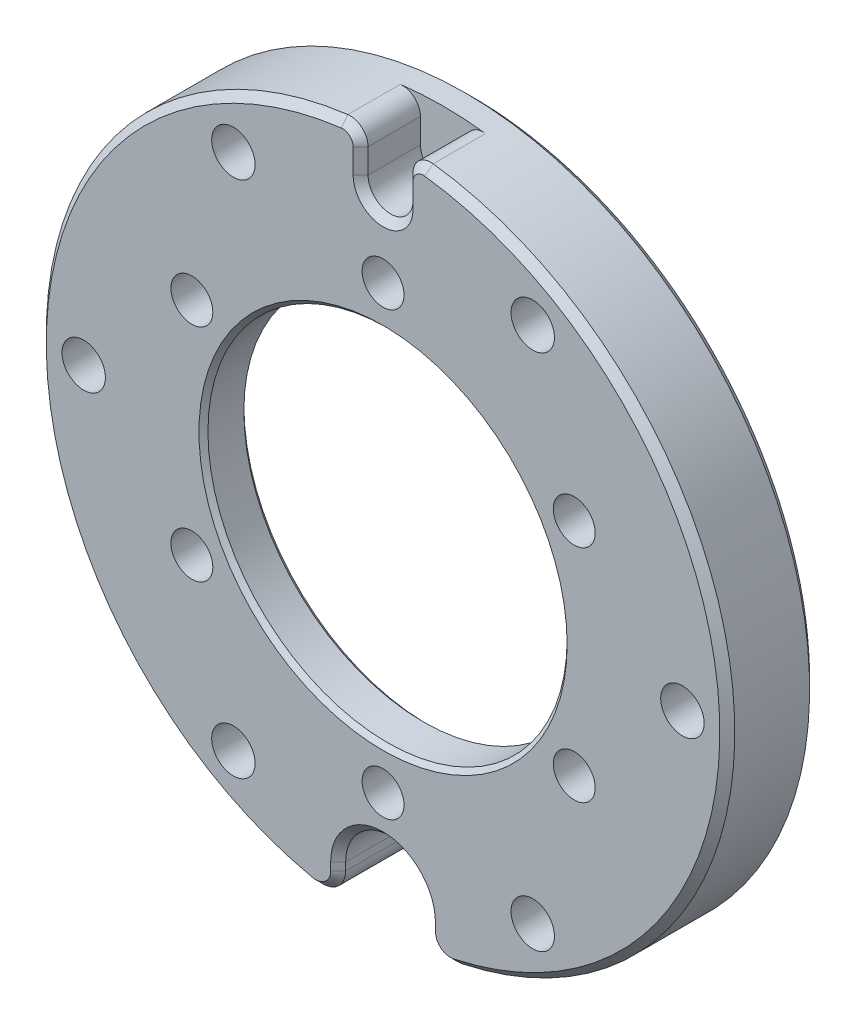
ISO-10303-21;
HEADER;
FILE_DESCRIPTION(('STEP AP214'),'2;1');
FILE_NAME('part.step','',(''),(''),'','','');
FILE_SCHEMA(('AUTOMOTIVE_DESIGN { 1 0 10303 214 1 1 1 1 }'));
ENDSEC;
DATA;
#1=APPLICATION_CONTEXT('core data for automotive mechanical design processes');
#2=APPLICATION_PROTOCOL_DEFINITION('international standard','automotive_design',2000,#1);
#3=PRODUCT_CONTEXT('',#1,'mechanical');
#4=PRODUCT('Part','Part','',(#3));
#5=PRODUCT_RELATED_PRODUCT_CATEGORY('part','',(#4));
#6=PRODUCT_DEFINITION_FORMATION('','',#4);
#7=PRODUCT_DEFINITION_CONTEXT('part definition',#1,'design');
#8=PRODUCT_DEFINITION('design','',#6,#7);
#9=PRODUCT_DEFINITION_SHAPE('','',#8);
#10=(LENGTH_UNIT() NAMED_UNIT(*) SI_UNIT(.MILLI.,.METRE.));
#11=(NAMED_UNIT(*) PLANE_ANGLE_UNIT() SI_UNIT($,.RADIAN.));
#12=(NAMED_UNIT(*) SI_UNIT($,.STERADIAN.) SOLID_ANGLE_UNIT());
#13=UNCERTAINTY_MEASURE_WITH_UNIT(LENGTH_MEASURE(1.E-05),#10,'distance_accuracy_value','');
#14=(GEOMETRIC_REPRESENTATION_CONTEXT(3) GLOBAL_UNCERTAINTY_ASSIGNED_CONTEXT((#13)) GLOBAL_UNIT_ASSIGNED_CONTEXT((#10,
#11,#12)) REPRESENTATION_CONTEXT('',''));
#15=CARTESIAN_POINT('',(0.,0.,0.));
#16=DIRECTION('',(0.,0.,1.));
#17=DIRECTION('',(1.,0.,0.));
#18=AXIS2_PLACEMENT_3D('',#15,#16,#17);
#19=CARTESIAN_POINT('',(0.,0.,0.));
#20=DIRECTION('',(0.,0.,-1.));
#21=DIRECTION('',(-1.,0.,0.));
#22=AXIS2_PLACEMENT_3D('',#19,#20,#21);
#23=CYLINDRICAL_SURFACE('',#22,23.);
#24=DIRECTION('',(0.,0.,-1.));
#25=VECTOR('',#24,1.);
#26=CARTESIAN_POINT('',(2.84862385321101,22.8229126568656,0.));
#27=LINE('',#26,#25);
#28=CARTESIAN_POINT('',(2.84862385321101,22.8229126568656,-1.));
#29=VERTEX_POINT('',#28);
#30=CARTESIAN_POINT('',(2.84862385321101,22.8229126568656,2.50000000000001));
#31=VERTEX_POINT('',#30);
#32=EDGE_CURVE('E399',#29,#31,#27,.F.);
#33=ORIENTED_EDGE('',*,*,#32,.T.);
#34=CARTESIAN_POINT('',(0.,0.,2.50000000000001));
#35=DIRECTION('',(0.,0.,1.));
#36=DIRECTION('',(1.,0.,0.));
#37=AXIS2_PLACEMENT_3D('',#34,#35,#36);
#38=CIRCLE('',#37,23.);
#39=CARTESIAN_POINT('',(4.81395348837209,-22.4905725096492,2.50000000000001));
#40=VERTEX_POINT('',#39);
#41=EDGE_CURVE('E437',#31,#40,#38,.F.);
#42=ORIENTED_EDGE('',*,*,#41,.T.);
#43=DIRECTION('',(0.,0.,-1.));
#44=VECTOR('',#43,1.);
#45=CARTESIAN_POINT('',(4.81395348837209,-22.4905725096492,0.));
#46=LINE('',#45,#44);
#47=CARTESIAN_POINT('',(4.81395348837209,-22.4905725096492,-2.50000000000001));
#48=VERTEX_POINT('',#47);
#49=EDGE_CURVE('E423',#40,#48,#46,.T.);
#50=ORIENTED_EDGE('',*,*,#49,.T.);
#51=CARTESIAN_POINT('',(0.,0.,-2.50000000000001));
#52=DIRECTION('',(0.,0.,-1.));
#53=DIRECTION('',(-1.,0.,0.));
#54=AXIS2_PLACEMENT_3D('',#51,#52,#53);
#55=CIRCLE('',#54,23.);
#56=CARTESIAN_POINT('',(-4.81395348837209,-22.4905725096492,-2.50000000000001));
#57=VERTEX_POINT('',#56);
#58=EDGE_CURVE('E431',#48,#57,#55,.F.);
#59=ORIENTED_EDGE('',*,*,#58,.T.);
#60=DIRECTION('',(0.,0.,-1.));
#61=VECTOR('',#60,1.);
#62=CARTESIAN_POINT('',(-4.81395348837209,-22.4905725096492,0.));
#63=LINE('',#62,#61);
#64=CARTESIAN_POINT('',(-4.81395348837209,-22.4905725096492,2.50000000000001));
#65=VERTEX_POINT('',#64);
#66=EDGE_CURVE('E419',#57,#65,#63,.F.);
#67=ORIENTED_EDGE('',*,*,#66,.T.);
#68=CARTESIAN_POINT('',(0.,0.,2.50000000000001));
#69=DIRECTION('',(0.,0.,1.));
#70=DIRECTION('',(1.,0.,0.));
#71=AXIS2_PLACEMENT_3D('',#68,#69,#70);
#72=CIRCLE('',#71,23.);
#73=CARTESIAN_POINT('',(-2.84862385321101,22.8229126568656,2.50000000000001));
#74=VERTEX_POINT('',#73);
#75=EDGE_CURVE('E434',#65,#74,#72,.F.);
#76=ORIENTED_EDGE('',*,*,#75,.T.);
#77=DIRECTION('',(0.,0.,-1.));
#78=VECTOR('',#77,1.);
#79=CARTESIAN_POINT('',(-2.84862385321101,22.8229126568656,0.));
#80=LINE('',#79,#78);
#81=CARTESIAN_POINT('',(-2.84862385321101,22.8229126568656,-1.));
#82=VERTEX_POINT('',#81);
#83=EDGE_CURVE('E396',#74,#82,#80,.T.);
#84=ORIENTED_EDGE('',*,*,#83,.T.);
#85=CARTESIAN_POINT('',(0.,0.,-1.));
#86=DIRECTION('',(0.,0.,-1.));
#87=DIRECTION('',(-1.,0.,0.));
#88=AXIS2_PLACEMENT_3D('',#85,#86,#87);
#89=CIRCLE('',#88,23.);
#90=EDGE_CURVE('E375',#29,#82,#89,.F.);
#91=ORIENTED_EDGE('',*,*,#90,.F.);
#92=EDGE_LOOP('',(#33,#42,#50,#59,#67,#76,#84,#91));
#93=FACE_BOUND('',#92,.T.);
#94=ADVANCED_FACE('F44',(#93),#23,.T.);
#95=CARTESIAN_POINT('',(0.,23.,3.));
#96=DIRECTION('',(0.,0.,1.));
#97=DIRECTION('',(1.,0.,0.));
#98=AXIS2_PLACEMENT_3D('',#95,#96,#97);
#99=PLANE('',#98);
#100=CARTESIAN_POINT('',(0.,0.,3.));
#101=DIRECTION('',(0.,0.,1.));
#102=DIRECTION('',(1.,0.,0.));
#103=AXIS2_PLACEMENT_3D('',#100,#101,#102);
#104=CIRCLE('',#103,12.3);
#105=CARTESIAN_POINT('',(12.3,0.,3.));
#106=VERTEX_POINT('',#105);
#107=EDGE_CURVE('E54',#106,#106,#104,.F.);
#108=ORIENTED_EDGE('',*,*,#107,.T.);
#109=EDGE_LOOP('',(#108));
#110=FACE_BOUND('',#109,.T.);
#111=CARTESIAN_POINT('',(4.5,-21.0237960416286,3.));
#112=DIRECTION('',(0.,0.,1.));
#113=DIRECTION('',(1.,0.,0.));
#114=AXIS2_PLACEMENT_3D('',#111,#112,#113);
#115=CIRCLE('',#114,1.);
#116=CARTESIAN_POINT('',(3.49999999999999,-21.0237960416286,3.));
#117=VERTEX_POINT('',#116);
#118=CARTESIAN_POINT('',(4.7093023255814,-22.001647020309,3.));
#119=VERTEX_POINT('',#118);
#120=EDGE_CURVE('E471',#117,#119,#115,.T.);
#121=ORIENTED_EDGE('',*,*,#120,.T.);
#122=CARTESIAN_POINT('',(0.,0.,3.));
#123=DIRECTION('',(0.,0.,1.));
#124=DIRECTION('',(1.,0.,0.));
#125=AXIS2_PLACEMENT_3D('',#122,#123,#124);
#126=CIRCLE('',#125,22.5);
#127=CARTESIAN_POINT('',(2.78669724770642,22.3267623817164,3.));
#128=VERTEX_POINT('',#127);
#129=EDGE_CURVE('E474',#119,#128,#126,.T.);
#130=ORIENTED_EDGE('',*,*,#129,.T.);
#131=CARTESIAN_POINT('',(2.7,21.6321519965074,3.));
#132=DIRECTION('',(0.,0.,1.));
#133=DIRECTION('',(1.,0.,0.));
#134=AXIS2_PLACEMENT_3D('',#131,#132,#133);
#135=CIRCLE('',#134,0.700000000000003);
#136=CARTESIAN_POINT('',(2.,21.6321519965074,3.));
#137=VERTEX_POINT('',#136);
#138=EDGE_CURVE('E468',#128,#137,#135,.T.);
#139=ORIENTED_EDGE('',*,*,#138,.T.);
#140=DIRECTION('',(0.,-1.,0.));
#141=VECTOR('',#140,1.);
#142=CARTESIAN_POINT('',(2.,23.,3.));
#143=LINE('',#142,#141);
#144=CARTESIAN_POINT('',(2.,20.,3.));
#145=VERTEX_POINT('',#144);
#146=EDGE_CURVE('E462',#137,#145,#143,.T.);
#147=ORIENTED_EDGE('',*,*,#146,.T.);
#148=CARTESIAN_POINT('',(0.,20.,3.));
#149=DIRECTION('',(0.,0.,1.));
#150=DIRECTION('',(1.,0.,0.));
#151=AXIS2_PLACEMENT_3D('',#148,#149,#150);
#152=CIRCLE('',#151,2.);
#153=CARTESIAN_POINT('',(-2.,20.,3.));
#154=VERTEX_POINT('',#153);
#155=EDGE_CURVE('E456',#145,#154,#152,.F.);
#156=ORIENTED_EDGE('',*,*,#155,.T.);
#157=DIRECTION('',(0.,1.,0.));
#158=VECTOR('',#157,1.);
#159=CARTESIAN_POINT('',(-2.,23.,3.));
#160=LINE('',#159,#158);
#161=CARTESIAN_POINT('',(-1.99999999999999,21.6321519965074,3.));
#162=VERTEX_POINT('',#161);
#163=EDGE_CURVE('E450',#154,#162,#160,.T.);
#164=ORIENTED_EDGE('',*,*,#163,.T.);
#165=CARTESIAN_POINT('',(-2.7,21.6321519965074,3.));
#166=DIRECTION('',(0.,0.,1.));
#167=DIRECTION('',(1.,0.,0.));
#168=AXIS2_PLACEMENT_3D('',#165,#166,#167);
#169=CIRCLE('',#168,0.700000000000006);
#170=CARTESIAN_POINT('',(-2.78669724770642,22.3267623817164,3.));
#171=VERTEX_POINT('',#170);
#172=EDGE_CURVE('E444',#162,#171,#169,.T.);
#173=ORIENTED_EDGE('',*,*,#172,.T.);
#174=CARTESIAN_POINT('',(0.,0.,3.));
#175=DIRECTION('',(0.,0.,1.));
#176=DIRECTION('',(1.,0.,0.));
#177=AXIS2_PLACEMENT_3D('',#174,#175,#176);
#178=CIRCLE('',#177,22.5);
#179=CARTESIAN_POINT('',(-4.7093023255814,-22.001647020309,3.));
#180=VERTEX_POINT('',#179);
#181=EDGE_CURVE('E441',#171,#180,#178,.T.);
#182=ORIENTED_EDGE('',*,*,#181,.T.);
#183=CARTESIAN_POINT('',(-4.5,-21.0237960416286,3.));
#184=DIRECTION('',(0.,0.,1.));
#185=DIRECTION('',(1.,0.,0.));
#186=AXIS2_PLACEMENT_3D('',#183,#184,#185);
#187=CIRCLE('',#186,1.);
#188=CARTESIAN_POINT('',(-3.5,-21.0237960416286,3.));
#189=VERTEX_POINT('',#188);
#190=EDGE_CURVE('E447',#180,#189,#187,.T.);
#191=ORIENTED_EDGE('',*,*,#190,.T.);
#192=DIRECTION('',(0.,1.,0.));
#193=VECTOR('',#192,1.);
#194=CARTESIAN_POINT('',(-3.5,-20.5,3.));
#195=LINE('',#194,#193);
#196=CARTESIAN_POINT('',(-3.5,-20.5,3.));
#197=VERTEX_POINT('',#196);
#198=EDGE_CURVE('E453',#189,#197,#195,.T.);
#199=ORIENTED_EDGE('',*,*,#198,.T.);
#200=CARTESIAN_POINT('',(0.,-20.5,3.));
#201=DIRECTION('',(0.,0.,1.));
#202=DIRECTION('',(1.,0.,0.));
#203=AXIS2_PLACEMENT_3D('',#200,#201,#202);
#204=CIRCLE('',#203,3.5);
#205=CARTESIAN_POINT('',(3.49999999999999,-20.5,3.));
#206=VERTEX_POINT('',#205);
#207=EDGE_CURVE('E459',#197,#206,#204,.F.);
#208=ORIENTED_EDGE('',*,*,#207,.T.);
#209=DIRECTION('',(0.,-1.,0.));
#210=VECTOR('',#209,1.);
#211=CARTESIAN_POINT('',(3.49999999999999,-21.0237960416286,3.));
#212=LINE('',#211,#210);
#213=EDGE_CURVE('E465',#206,#117,#212,.T.);
#214=ORIENTED_EDGE('',*,*,#213,.T.);
#215=EDGE_LOOP('',(#121,#130,#139,#147,#156,#164,#173,#182,#191,#199,#208,#214));
#216=FACE_BOUND('',#215,.T.);
#217=CARTESIAN_POINT('',(-20.,2.09901540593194E-13,3.));
#218=DIRECTION('',(0.,0.,-1.));
#219=DIRECTION('',(-1.,0.,0.));
#220=AXIS2_PLACEMENT_3D('',#217,#218,#219);
#221=CIRCLE('',#220,1.45);
#222=CARTESIAN_POINT('',(-21.45,2.09901540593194E-13,3.));
#223=VERTEX_POINT('',#222);
#224=EDGE_CURVE('E258',#223,#223,#221,.T.);
#225=ORIENTED_EDGE('',*,*,#224,.T.);
#226=EDGE_LOOP('',(#225));
#227=FACE_BOUND('',#226,.T.);
#228=CARTESIAN_POINT('',(-10.0000000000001,-17.3205080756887,3.));
#229=DIRECTION('',(0.,0.,-1.));
#230=DIRECTION('',(-1.,0.,0.));
#231=AXIS2_PLACEMENT_3D('',#228,#229,#230);
#232=CIRCLE('',#231,1.45);
#233=CARTESIAN_POINT('',(-11.4500000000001,-17.3205080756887,3.));
#234=VERTEX_POINT('',#233);
#235=EDGE_CURVE('E274',#234,#234,#232,.T.);
#236=ORIENTED_EDGE('',*,*,#235,.T.);
#237=EDGE_LOOP('',(#236));
#238=FACE_BOUND('',#237,.T.);
#239=CARTESIAN_POINT('',(10.,-17.3205080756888,3.));
#240=DIRECTION('',(0.,0.,-1.));
#241=DIRECTION('',(-1.,0.,0.));
#242=AXIS2_PLACEMENT_3D('',#239,#240,#241);
#243=CIRCLE('',#242,1.45);
#244=CARTESIAN_POINT('',(8.55000000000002,-17.3205080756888,3.));
#245=VERTEX_POINT('',#244);
#246=EDGE_CURVE('E290',#245,#245,#243,.T.);
#247=ORIENTED_EDGE('',*,*,#246,.T.);
#248=EDGE_LOOP('',(#247));
#249=FACE_BOUND('',#248,.T.);
#250=CARTESIAN_POINT('',(20.,0.,3.));
#251=DIRECTION('',(0.,0.,-1.));
#252=DIRECTION('',(-1.,0.,0.));
#253=AXIS2_PLACEMENT_3D('',#250,#251,#252);
#254=CIRCLE('',#253,1.45);
#255=CARTESIAN_POINT('',(18.55,0.,3.));
#256=VERTEX_POINT('',#255);
#257=EDGE_CURVE('E305',#256,#256,#254,.T.);
#258=ORIENTED_EDGE('',*,*,#257,.T.);
#259=EDGE_LOOP('',(#258));
#260=FACE_BOUND('',#259,.T.);
#261=CARTESIAN_POINT('',(10.,17.3205080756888,3.));
#262=DIRECTION('',(0.,0.,-1.));
#263=DIRECTION('',(-1.,0.,0.));
#264=AXIS2_PLACEMENT_3D('',#261,#262,#263);
#265=CIRCLE('',#264,1.45);
#266=CARTESIAN_POINT('',(8.55000000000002,17.3205080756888,3.));
#267=VERTEX_POINT('',#266);
#268=EDGE_CURVE('E321',#267,#267,#265,.T.);
#269=ORIENTED_EDGE('',*,*,#268,.T.);
#270=EDGE_LOOP('',(#269));
#271=FACE_BOUND('',#270,.T.);
#272=CARTESIAN_POINT('',(-10.,17.3205080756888,3.));
#273=DIRECTION('',(0.,0.,-1.));
#274=DIRECTION('',(-1.,0.,0.));
#275=AXIS2_PLACEMENT_3D('',#272,#273,#274);
#276=CIRCLE('',#275,1.45);
#277=CARTESIAN_POINT('',(-11.45,17.3205080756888,3.));
#278=VERTEX_POINT('',#277);
#279=EDGE_CURVE('E337',#278,#278,#276,.T.);
#280=ORIENTED_EDGE('',*,*,#279,.T.);
#281=EDGE_LOOP('',(#280));
#282=FACE_BOUND('',#281,.T.);
#283=CARTESIAN_POINT('',(12.7738747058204,7.37500000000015,3.));
#284=DIRECTION('',(0.,0.,1.));
#285=DIRECTION('',(1.,0.,0.));
#286=AXIS2_PLACEMENT_3D('',#283,#284,#285);
#287=CIRCLE('',#286,1.4);
#288=CARTESIAN_POINT('',(14.1738747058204,7.37500000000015,3.));
#289=VERTEX_POINT('',#288);
#290=EDGE_CURVE('E361',#289,#289,#287,.T.);
#291=ORIENTED_EDGE('',*,*,#290,.F.);
#292=EDGE_LOOP('',(#291));
#293=FACE_BOUND('',#292,.T.);
#294=CARTESIAN_POINT('',(12.7738747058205,-7.37499999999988,3.));
#295=DIRECTION('',(0.,0.,1.));
#296=DIRECTION('',(1.,0.,0.));
#297=AXIS2_PLACEMENT_3D('',#294,#295,#296);
#298=CIRCLE('',#297,1.4);
#299=CARTESIAN_POINT('',(14.1738747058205,-7.37499999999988,3.));
#300=VERTEX_POINT('',#299);
#301=EDGE_CURVE('E356',#300,#300,#298,.T.);
#302=ORIENTED_EDGE('',*,*,#301,.F.);
#303=EDGE_LOOP('',(#302));
#304=FACE_BOUND('',#303,.T.);
#305=CARTESIAN_POINT('',(0.,-14.75,3.));
#306=DIRECTION('',(0.,0.,1.));
#307=DIRECTION('',(1.,0.,0.));
#308=AXIS2_PLACEMENT_3D('',#305,#306,#307);
#309=CIRCLE('',#308,1.4);
#310=CARTESIAN_POINT('',(1.4,-14.75,3.));
#311=VERTEX_POINT('',#310);
#312=EDGE_CURVE('E351',#311,#311,#309,.T.);
#313=ORIENTED_EDGE('',*,*,#312,.F.);
#314=EDGE_LOOP('',(#313));
#315=FACE_BOUND('',#314,.T.);
#316=CARTESIAN_POINT('',(-12.7738747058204,-7.37500000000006,3.));
#317=DIRECTION('',(0.,0.,1.));
#318=DIRECTION('',(1.,0.,0.));
#319=AXIS2_PLACEMENT_3D('',#316,#317,#318);
#320=CIRCLE('',#319,1.4);
#321=CARTESIAN_POINT('',(-11.3738747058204,-7.37500000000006,3.));
#322=VERTEX_POINT('',#321);
#323=EDGE_CURVE('E346',#322,#322,#320,.T.);
#324=ORIENTED_EDGE('',*,*,#323,.F.);
#325=EDGE_LOOP('',(#324));
#326=FACE_BOUND('',#325,.T.);
#327=CARTESIAN_POINT('',(-12.7738747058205,7.37499999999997,3.));
#328=DIRECTION('',(0.,0.,1.));
#329=DIRECTION('',(1.,0.,0.));
#330=AXIS2_PLACEMENT_3D('',#327,#328,#329);
#331=CIRCLE('',#330,1.4);
#332=CARTESIAN_POINT('',(-11.3738747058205,7.37499999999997,3.));
#333=VERTEX_POINT('',#332);
#334=EDGE_CURVE('E341',#333,#333,#331,.T.);
#335=ORIENTED_EDGE('',*,*,#334,.F.);
#336=EDGE_LOOP('',(#335));
#337=FACE_BOUND('',#336,.T.);
#338=CARTESIAN_POINT('',(0.,14.75,3.));
#339=DIRECTION('',(0.,0.,1.));
#340=DIRECTION('',(1.,0.,0.));
#341=AXIS2_PLACEMENT_3D('',#338,#339,#340);
#342=CIRCLE('',#341,1.4);
#343=CARTESIAN_POINT('',(1.4,14.75,3.));
#344=VERTEX_POINT('',#343);
#345=EDGE_CURVE('E366',#344,#344,#342,.T.);
#346=ORIENTED_EDGE('',*,*,#345,.F.);
#347=EDGE_LOOP('',(#346));
#348=FACE_BOUND('',#347,.T.);
#349=ADVANCED_FACE('F647',(#110,#216,#227,#238,#249,#260,#271,#282,#293,#304,#315,#326,#337,
#348),#99,.T.);
#350=CARTESIAN_POINT('',(0.,0.,0.));
#351=DIRECTION('',(0.,0.,-1.));
#352=DIRECTION('',(-1.,0.,0.));
#353=AXIS2_PLACEMENT_3D('',#350,#351,#352);
#354=PLANE('',#353);
#355=CARTESIAN_POINT('',(0.,0.,0.));
#356=DIRECTION('',(0.,0.,-1.));
#357=DIRECTION('',(-1.,0.,0.));
#358=AXIS2_PLACEMENT_3D('',#355,#356,#357);
#359=CIRCLE('',#358,12.3);
#360=CARTESIAN_POINT('',(-12.3,0.,0.));
#361=VERTEX_POINT('',#360);
#362=EDGE_CURVE('E11',#361,#361,#359,.F.);
#363=ORIENTED_EDGE('',*,*,#362,.T.);
#364=EDGE_LOOP('',(#363));
#365=FACE_BOUND('',#364,.T.);
#366=CARTESIAN_POINT('',(12.7738747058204,7.37500000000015,0.));
#367=DIRECTION('',(0.,0.,-1.));
#368=DIRECTION('',(-1.,0.,0.));
#369=AXIS2_PLACEMENT_3D('',#366,#367,#368);
#370=CIRCLE('',#369,1.4);
#371=CARTESIAN_POINT('',(11.3738747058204,7.37500000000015,0.));
#372=VERTEX_POINT('',#371);
#373=EDGE_CURVE('E362',#372,#372,#370,.T.);
#374=ORIENTED_EDGE('',*,*,#373,.F.);
#375=EDGE_LOOP('',(#374));
#376=FACE_BOUND('',#375,.T.);
#377=CARTESIAN_POINT('',(12.7738747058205,-7.37499999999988,0.));
#378=DIRECTION('',(0.,0.,-1.));
#379=DIRECTION('',(-1.,0.,0.));
#380=AXIS2_PLACEMENT_3D('',#377,#378,#379);
#381=CIRCLE('',#380,1.4);
#382=CARTESIAN_POINT('',(11.3738747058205,-7.37499999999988,0.));
#383=VERTEX_POINT('',#382);
#384=EDGE_CURVE('E357',#383,#383,#381,.T.);
#385=ORIENTED_EDGE('',*,*,#384,.F.);
#386=EDGE_LOOP('',(#385));
#387=FACE_BOUND('',#386,.T.);
#388=CARTESIAN_POINT('',(0.,-14.75,0.));
#389=DIRECTION('',(0.,0.,-1.));
#390=DIRECTION('',(-1.,0.,0.));
#391=AXIS2_PLACEMENT_3D('',#388,#389,#390);
#392=CIRCLE('',#391,1.4);
#393=CARTESIAN_POINT('',(-1.4,-14.75,0.));
#394=VERTEX_POINT('',#393);
#395=EDGE_CURVE('E352',#394,#394,#392,.T.);
#396=ORIENTED_EDGE('',*,*,#395,.F.);
#397=EDGE_LOOP('',(#396));
#398=FACE_BOUND('',#397,.T.);
#399=CARTESIAN_POINT('',(-12.7738747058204,-7.37500000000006,0.));
#400=DIRECTION('',(0.,0.,-1.));
#401=DIRECTION('',(-1.,0.,0.));
#402=AXIS2_PLACEMENT_3D('',#399,#400,#401);
#403=CIRCLE('',#402,1.4);
#404=CARTESIAN_POINT('',(-14.1738747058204,-7.37500000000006,0.));
#405=VERTEX_POINT('',#404);
#406=EDGE_CURVE('E347',#405,#405,#403,.T.);
#407=ORIENTED_EDGE('',*,*,#406,.F.);
#408=EDGE_LOOP('',(#407));
#409=FACE_BOUND('',#408,.T.);
#410=CARTESIAN_POINT('',(-12.7738747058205,7.37499999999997,0.));
#411=DIRECTION('',(0.,0.,-1.));
#412=DIRECTION('',(-1.,0.,0.));
#413=AXIS2_PLACEMENT_3D('',#410,#411,#412);
#414=CIRCLE('',#413,1.4);
#415=CARTESIAN_POINT('',(-14.1738747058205,7.37499999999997,0.));
#416=VERTEX_POINT('',#415);
#417=EDGE_CURVE('E342',#416,#416,#414,.T.);
#418=ORIENTED_EDGE('',*,*,#417,.F.);
#419=EDGE_LOOP('',(#418));
#420=FACE_BOUND('',#419,.T.);
#421=CARTESIAN_POINT('',(0.,14.75,0.));
#422=DIRECTION('',(0.,0.,-1.));
#423=DIRECTION('',(-1.,0.,0.));
#424=AXIS2_PLACEMENT_3D('',#421,#422,#423);
#425=CIRCLE('',#424,1.4);
#426=CARTESIAN_POINT('',(-1.4,14.75,0.));
#427=VERTEX_POINT('',#426);
#428=EDGE_CURVE('E367',#427,#427,#425,.T.);
#429=ORIENTED_EDGE('',*,*,#428,.F.);
#430=EDGE_LOOP('',(#429));
#431=FACE_BOUND('',#430,.T.);
#432=CARTESIAN_POINT('',(0.,0.,0.));
#433=DIRECTION('',(0.,0.,-1.));
#434=DIRECTION('',(-1.,0.,0.));
#435=AXIS2_PLACEMENT_3D('',#432,#433,#434);
#436=CIRCLE('',#435,16.5);
#437=CARTESIAN_POINT('',(-16.5,0.,0.));
#438=VERTEX_POINT('',#437);
#439=EDGE_CURVE('E371',#438,#438,#436,.T.);
#440=ORIENTED_EDGE('',*,*,#439,.T.);
#441=EDGE_LOOP('',(#440));
#442=FACE_BOUND('',#441,.T.);
#443=ADVANCED_FACE('F675',(#365,#376,#387,#398,#409,#420,#431,#442),#354,.T.);
#444=CARTESIAN_POINT('',(0.,0.,0.));
#445=DIRECTION('',(0.,0.,-1.));
#446=DIRECTION('',(-1.,0.,0.));
#447=AXIS2_PLACEMENT_3D('',#444,#445,#446);
#448=CYLINDRICAL_SURFACE('',#447,16.5);
#449=CARTESIAN_POINT('',(0.,0.,-2.50000000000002));
#450=DIRECTION('',(0.,0.,-1.));
#451=DIRECTION('',(-1.,0.,0.));
#452=AXIS2_PLACEMENT_3D('',#449,#450,#451);
#453=CIRCLE('',#452,16.5);
#454=CARTESIAN_POINT('',(-16.5,0.,-2.50000000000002));
#455=VERTEX_POINT('',#454);
#456=EDGE_CURVE('E560',#455,#455,#453,.T.);
#457=ORIENTED_EDGE('',*,*,#456,.T.);
#458=EDGE_LOOP('',(#457));
#459=FACE_BOUND('',#458,.T.);
#460=ORIENTED_EDGE('',*,*,#439,.F.);
#461=EDGE_LOOP('',(#460));
#462=FACE_BOUND('',#461,.T.);
#463=ADVANCED_FACE('F683',(#459,#462),#448,.F.);
#464=CARTESIAN_POINT('',(0.,16.5,-3.));
#465=DIRECTION('',(0.,0.,-1.));
#466=DIRECTION('',(-1.,0.,0.));
#467=AXIS2_PLACEMENT_3D('',#464,#465,#466);
#468=PLANE('',#467);
#469=CARTESIAN_POINT('',(0.,-20.5,-3.));
#470=DIRECTION('',(0.,0.,-1.));
#471=DIRECTION('',(-1.,0.,0.));
#472=AXIS2_PLACEMENT_3D('',#469,#470,#471);
#473=CIRCLE('',#472,3.5);
#474=CARTESIAN_POINT('',(3.5,-20.5,-3.));
#475=VERTEX_POINT('',#474);
#476=CARTESIAN_POINT('',(0.,-17.,-3.));
#477=VERTEX_POINT('',#476);
#478=EDGE_CURVE('E556',#475,#477,#473,.F.);
#479=ORIENTED_EDGE('',*,*,#478,.T.);
#480=CARTESIAN_POINT('',(0.,0.,-3.));
#481=DIRECTION('',(0.,0.,-1.));
#482=DIRECTION('',(-1.,0.,0.));
#483=AXIS2_PLACEMENT_3D('',#480,#481,#482);
#484=CIRCLE('',#483,17.);
#485=EDGE_CURVE('E59',#477,#477,#484,.F.);
#486=ORIENTED_EDGE('',*,*,#485,.T.);
#487=CARTESIAN_POINT('',(-3.5,-20.5,-3.));
#488=VERTEX_POINT('',#487);
#489=EDGE_CURVE('E65',#477,#488,#473,.F.);
#490=ORIENTED_EDGE('',*,*,#489,.T.);
#491=DIRECTION('',(0.,-1.,0.));
#492=VECTOR('',#491,1.);
#493=CARTESIAN_POINT('',(-3.5,-21.0237960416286,-3.));
#494=LINE('',#493,#492);
#495=CARTESIAN_POINT('',(-3.5,-21.0237960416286,-3.));
#496=VERTEX_POINT('',#495);
#497=EDGE_CURVE('E553',#488,#496,#494,.T.);
#498=ORIENTED_EDGE('',*,*,#497,.T.);
#499=CARTESIAN_POINT('',(-4.5,-21.0237960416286,-3.));
#500=DIRECTION('',(0.,0.,-1.));
#501=DIRECTION('',(-1.,0.,0.));
#502=AXIS2_PLACEMENT_3D('',#499,#500,#501);
#503=CIRCLE('',#502,1.);
#504=CARTESIAN_POINT('',(-4.7093023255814,-22.001647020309,-3.));
#505=VERTEX_POINT('',#504);
#506=EDGE_CURVE('E547',#496,#505,#503,.T.);
#507=ORIENTED_EDGE('',*,*,#506,.T.);
#508=CARTESIAN_POINT('',(0.,0.,-3.));
#509=DIRECTION('',(0.,0.,-1.));
#510=DIRECTION('',(-1.,0.,0.));
#511=AXIS2_PLACEMENT_3D('',#508,#509,#510);
#512=CIRCLE('',#511,22.5);
#513=CARTESIAN_POINT('',(-11.2500000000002,-19.4855715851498,-3.));
#514=VERTEX_POINT('',#513);
#515=EDGE_CURVE('E541',#505,#514,#512,.T.);
#516=ORIENTED_EDGE('',*,*,#515,.T.);
#517=CARTESIAN_POINT('',(-10.0000000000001,-17.3205080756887,-3.));
#518=DIRECTION('',(0.,0.,-1.));
#519=DIRECTION('',(-1.,0.,0.));
#520=AXIS2_PLACEMENT_3D('',#517,#518,#519);
#521=CIRCLE('',#520,2.5);
#522=EDGE_CURVE('E262',#514,#514,#521,.T.);
#523=ORIENTED_EDGE('',*,*,#522,.F.);
#524=CARTESIAN_POINT('',(0.,0.,-3.));
#525=DIRECTION('',(0.,0.,-1.));
#526=DIRECTION('',(-1.,0.,0.));
#527=AXIS2_PLACEMENT_3D('',#524,#525,#526);
#528=CIRCLE('',#527,22.5);
#529=CARTESIAN_POINT('',(-22.5,2.36139233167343E-13,-3.));
#530=VERTEX_POINT('',#529);
#531=EDGE_CURVE('E538',#514,#530,#528,.T.);
#532=ORIENTED_EDGE('',*,*,#531,.T.);
#533=CARTESIAN_POINT('',(-20.,2.09901540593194E-13,-3.));
#534=DIRECTION('',(0.,0.,-1.));
#535=DIRECTION('',(-1.,0.,0.));
#536=AXIS2_PLACEMENT_3D('',#533,#534,#535);
#537=CIRCLE('',#536,2.5);
#538=EDGE_CURVE('E239',#530,#530,#537,.T.);
#539=ORIENTED_EDGE('',*,*,#538,.F.);
#540=CARTESIAN_POINT('',(0.,0.,-3.));
#541=DIRECTION('',(0.,0.,-1.));
#542=DIRECTION('',(-1.,0.,0.));
#543=AXIS2_PLACEMENT_3D('',#540,#541,#542);
#544=CIRCLE('',#543,22.5);
#545=CARTESIAN_POINT('',(-11.25,19.4855715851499,-3.));
#546=VERTEX_POINT('',#545);
#547=EDGE_CURVE('E535',#530,#546,#544,.T.);
#548=ORIENTED_EDGE('',*,*,#547,.T.);
#549=CARTESIAN_POINT('',(-10.,17.3205080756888,-3.));
#550=DIRECTION('',(0.,0.,-1.));
#551=DIRECTION('',(-1.,0.,0.));
#552=AXIS2_PLACEMENT_3D('',#549,#550,#551);
#553=CIRCLE('',#552,2.5);
#554=EDGE_CURVE('E325',#546,#546,#553,.T.);
#555=ORIENTED_EDGE('',*,*,#554,.F.);
#556=CARTESIAN_POINT('',(0.,0.,-3.));
#557=DIRECTION('',(0.,0.,-1.));
#558=DIRECTION('',(-1.,0.,0.));
#559=AXIS2_PLACEMENT_3D('',#556,#557,#558);
#560=CIRCLE('',#559,22.5);
#561=CARTESIAN_POINT('',(11.25,19.4855715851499,-3.));
#562=VERTEX_POINT('',#561);
#563=EDGE_CURVE('E532',#546,#562,#560,.T.);
#564=ORIENTED_EDGE('',*,*,#563,.T.);
#565=CARTESIAN_POINT('',(10.,17.3205080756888,-3.));
#566=DIRECTION('',(0.,0.,-1.));
#567=DIRECTION('',(-1.,0.,0.));
#568=AXIS2_PLACEMENT_3D('',#565,#566,#567);
#569=CIRCLE('',#568,2.5);
#570=EDGE_CURVE('E309',#562,#562,#569,.T.);
#571=ORIENTED_EDGE('',*,*,#570,.F.);
#572=CARTESIAN_POINT('',(0.,0.,-3.));
#573=DIRECTION('',(0.,0.,-1.));
#574=DIRECTION('',(-1.,0.,0.));
#575=AXIS2_PLACEMENT_3D('',#572,#573,#574);
#576=CIRCLE('',#575,22.5);
#577=CARTESIAN_POINT('',(22.5,0.,-3.));
#578=VERTEX_POINT('',#577);
#579=EDGE_CURVE('E529',#562,#578,#576,.T.);
#580=ORIENTED_EDGE('',*,*,#579,.T.);
#581=CARTESIAN_POINT('',(20.,0.,-3.));
#582=DIRECTION('',(0.,0.,-1.));
#583=DIRECTION('',(-1.,0.,0.));
#584=AXIS2_PLACEMENT_3D('',#581,#582,#583);
#585=CIRCLE('',#584,2.5);
#586=EDGE_CURVE('E293',#578,#578,#585,.T.);
#587=ORIENTED_EDGE('',*,*,#586,.F.);
#588=CARTESIAN_POINT('',(0.,0.,-3.));
#589=DIRECTION('',(0.,0.,-1.));
#590=DIRECTION('',(-1.,0.,0.));
#591=AXIS2_PLACEMENT_3D('',#588,#589,#590);
#592=CIRCLE('',#591,22.5);
#593=CARTESIAN_POINT('',(11.25,-19.4855715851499,-3.));
#594=VERTEX_POINT('',#593);
#595=EDGE_CURVE('E526',#578,#594,#592,.T.);
#596=ORIENTED_EDGE('',*,*,#595,.T.);
#597=CARTESIAN_POINT('',(10.,-17.3205080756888,-3.));
#598=DIRECTION('',(0.,0.,-1.));
#599=DIRECTION('',(-1.,0.,0.));
#600=AXIS2_PLACEMENT_3D('',#597,#598,#599);
#601=CIRCLE('',#600,2.5);
#602=EDGE_CURVE('E278',#594,#594,#601,.T.);
#603=ORIENTED_EDGE('',*,*,#602,.F.);
#604=CARTESIAN_POINT('',(0.,0.,-3.));
#605=DIRECTION('',(0.,0.,-1.));
#606=DIRECTION('',(-1.,0.,0.));
#607=AXIS2_PLACEMENT_3D('',#604,#605,#606);
#608=CIRCLE('',#607,22.5);
#609=CARTESIAN_POINT('',(4.7093023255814,-22.001647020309,-3.));
#610=VERTEX_POINT('',#609);
#611=EDGE_CURVE('E523',#594,#610,#608,.T.);
#612=ORIENTED_EDGE('',*,*,#611,.T.);
#613=CARTESIAN_POINT('',(4.5,-21.0237960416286,-3.));
#614=DIRECTION('',(0.,0.,-1.));
#615=DIRECTION('',(-1.,0.,0.));
#616=AXIS2_PLACEMENT_3D('',#613,#614,#615);
#617=CIRCLE('',#616,1.);
#618=CARTESIAN_POINT('',(3.49999999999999,-21.0237960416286,-3.));
#619=VERTEX_POINT('',#618);
#620=EDGE_CURVE('E544',#610,#619,#617,.T.);
#621=ORIENTED_EDGE('',*,*,#620,.T.);
#622=DIRECTION('',(0.,1.,0.));
#623=VECTOR('',#622,1.);
#624=CARTESIAN_POINT('',(3.5,-20.5,-3.));
#625=LINE('',#624,#623);
#626=EDGE_CURVE('E550',#619,#475,#625,.T.);
#627=ORIENTED_EDGE('',*,*,#626,.T.);
#628=EDGE_LOOP('',(#479,#486,#490,#498,#507,#516,#523,#532,#539,#548,#555,#564,#571,#580,#587,
#596,#603,#612,#621,#627));
#629=FACE_BOUND('',#628,.T.);
#630=ADVANCED_FACE('F679',(#629),#468,.T.);
#631=CARTESIAN_POINT('',(0.,14.75,-3.));
#632=DIRECTION('',(0.,0.,1.));
#633=DIRECTION('',(1.,0.,0.));
#634=AXIS2_PLACEMENT_3D('',#631,#632,#633);
#635=CYLINDRICAL_SURFACE('',#634,1.4);
#636=ORIENTED_EDGE('',*,*,#428,.T.);
#637=EDGE_LOOP('',(#636));
#638=FACE_BOUND('',#637,.T.);
#639=ORIENTED_EDGE('',*,*,#345,.T.);
#640=EDGE_LOOP('',(#639));
#641=FACE_BOUND('',#640,.T.);
#642=ADVANCED_FACE('F682',(#638,#641),#635,.F.);
#643=CARTESIAN_POINT('',(-12.7738747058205,7.37499999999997,-3.));
#644=DIRECTION('',(0.,0.,1.));
#645=DIRECTION('',(1.,0.,0.));
#646=AXIS2_PLACEMENT_3D('',#643,#644,#645);
#647=CYLINDRICAL_SURFACE('',#646,1.4);
#648=ORIENTED_EDGE('',*,*,#417,.T.);
#649=EDGE_LOOP('',(#648));
#650=FACE_BOUND('',#649,.T.);
#651=ORIENTED_EDGE('',*,*,#334,.T.);
#652=EDGE_LOOP('',(#651));
#653=FACE_BOUND('',#652,.T.);
#654=ADVANCED_FACE('F1432',(#650,#653),#647,.F.);
#655=CARTESIAN_POINT('',(-12.7738747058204,-7.37500000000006,-3.));
#656=DIRECTION('',(0.,0.,1.));
#657=DIRECTION('',(1.,0.,0.));
#658=AXIS2_PLACEMENT_3D('',#655,#656,#657);
#659=CYLINDRICAL_SURFACE('',#658,1.4);
#660=ORIENTED_EDGE('',*,*,#406,.T.);
#661=EDGE_LOOP('',(#660));
#662=FACE_BOUND('',#661,.T.);
#663=ORIENTED_EDGE('',*,*,#323,.T.);
#664=EDGE_LOOP('',(#663));
#665=FACE_BOUND('',#664,.T.);
#666=ADVANCED_FACE('F1420',(#662,#665),#659,.F.);
#667=CARTESIAN_POINT('',(0.,-14.75,-3.));
#668=DIRECTION('',(0.,0.,1.));
#669=DIRECTION('',(1.,0.,0.));
#670=AXIS2_PLACEMENT_3D('',#667,#668,#669);
#671=CYLINDRICAL_SURFACE('',#670,1.4);
#672=ORIENTED_EDGE('',*,*,#395,.T.);
#673=EDGE_LOOP('',(#672));
#674=FACE_BOUND('',#673,.T.);
#675=ORIENTED_EDGE('',*,*,#312,.T.);
#676=EDGE_LOOP('',(#675));
#677=FACE_BOUND('',#676,.T.);
#678=ADVANCED_FACE('F1408',(#674,#677),#671,.F.);
#679=CARTESIAN_POINT('',(12.7738747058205,-7.37499999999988,-3.));
#680=DIRECTION('',(0.,0.,1.));
#681=DIRECTION('',(1.,0.,0.));
#682=AXIS2_PLACEMENT_3D('',#679,#680,#681);
#683=CYLINDRICAL_SURFACE('',#682,1.4);
#684=ORIENTED_EDGE('',*,*,#384,.T.);
#685=EDGE_LOOP('',(#684));
#686=FACE_BOUND('',#685,.T.);
#687=ORIENTED_EDGE('',*,*,#301,.T.);
#688=EDGE_LOOP('',(#687));
#689=FACE_BOUND('',#688,.T.);
#690=ADVANCED_FACE('F1396',(#686,#689),#683,.F.);
#691=CARTESIAN_POINT('',(12.7738747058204,7.37500000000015,-3.));
#692=DIRECTION('',(0.,0.,1.));
#693=DIRECTION('',(1.,0.,0.));
#694=AXIS2_PLACEMENT_3D('',#691,#692,#693);
#695=CYLINDRICAL_SURFACE('',#694,1.4);
#696=ORIENTED_EDGE('',*,*,#373,.T.);
#697=EDGE_LOOP('',(#696));
#698=FACE_BOUND('',#697,.T.);
#699=ORIENTED_EDGE('',*,*,#290,.T.);
#700=EDGE_LOOP('',(#699));
#701=FACE_BOUND('',#700,.T.);
#702=ADVANCED_FACE('F660',(#698,#701),#695,.F.);
#703=CARTESIAN_POINT('',(0.,0.,-3.));
#704=DIRECTION('',(0.,0.,1.));
#705=DIRECTION('',(1.,0.,0.));
#706=AXIS2_PLACEMENT_3D('',#703,#704,#705);
#707=CYLINDRICAL_SURFACE('',#706,12.);
#708=CARTESIAN_POINT('',(0.,0.,2.70000000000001));
#709=DIRECTION('',(0.,0.,1.));
#710=DIRECTION('',(1.,0.,0.));
#711=AXIS2_PLACEMENT_3D('',#708,#709,#710);
#712=CIRCLE('',#711,12.);
#713=CARTESIAN_POINT('',(12.,0.,2.70000000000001));
#714=VERTEX_POINT('',#713);
#715=EDGE_CURVE('E639',#714,#714,#712,.T.);
#716=ORIENTED_EDGE('',*,*,#715,.T.);
#717=EDGE_LOOP('',(#716));
#718=FACE_BOUND('',#717,.T.);
#719=CARTESIAN_POINT('',(0.,0.,0.300000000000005));
#720=DIRECTION('',(0.,0.,-1.));
#721=DIRECTION('',(-1.,0.,0.));
#722=AXIS2_PLACEMENT_3D('',#719,#720,#721);
#723=CIRCLE('',#722,12.);
#724=CARTESIAN_POINT('',(-12.,0.,0.300000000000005));
#725=VERTEX_POINT('',#724);
#726=EDGE_CURVE('E635',#725,#725,#723,.T.);
#727=ORIENTED_EDGE('',*,*,#726,.T.);
#728=EDGE_LOOP('',(#727));
#729=FACE_BOUND('',#728,.T.);
#730=ADVANCED_FACE('F656',(#718,#729),#707,.F.);
#731=CARTESIAN_POINT('',(-10.,17.3205080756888,-3.));
#732=DIRECTION('',(0.,0.,-1.));
#733=DIRECTION('',(-1.,0.,0.));
#734=AXIS2_PLACEMENT_3D('',#731,#732,#733);
#735=CYLINDRICAL_SURFACE('',#734,1.45000000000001);
#736=ORIENTED_EDGE('',*,*,#279,.F.);
#737=EDGE_LOOP('',(#736));
#738=FACE_BOUND('',#737,.T.);
#739=CARTESIAN_POINT('',(-10.,17.3205080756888,-0.1));
#740=DIRECTION('',(0.,0.,-1.));
#741=DIRECTION('',(-1.,0.,0.));
#742=AXIS2_PLACEMENT_3D('',#739,#740,#741);
#743=CIRCLE('',#742,1.45000000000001);
#744=CARTESIAN_POINT('',(-11.45,17.3205080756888,-0.1));
#745=VERTEX_POINT('',#744);
#746=EDGE_CURVE('E333',#745,#745,#743,.T.);
#747=ORIENTED_EDGE('',*,*,#746,.T.);
#748=EDGE_LOOP('',(#747));
#749=FACE_BOUND('',#748,.T.);
#750=ADVANCED_FACE('F659',(#738,#749),#735,.F.);
#751=CARTESIAN_POINT('',(-8.55000000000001,17.3205080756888,-0.1));
#752=DIRECTION('',(0.,0.,1.));
#753=DIRECTION('',(1.,0.,0.));
#754=AXIS2_PLACEMENT_3D('',#751,#752,#753);
#755=PLANE('',#754);
#756=ORIENTED_EDGE('',*,*,#746,.F.);
#757=EDGE_LOOP('',(#756));
#758=FACE_BOUND('',#757,.T.);
#759=CARTESIAN_POINT('',(-10.,17.3205080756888,-0.1));
#760=DIRECTION('',(0.,0.,-1.));
#761=DIRECTION('',(-1.,0.,0.));
#762=AXIS2_PLACEMENT_3D('',#759,#760,#761);
#763=CIRCLE('',#762,2.5);
#764=CARTESIAN_POINT('',(-12.5,17.3205080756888,-0.1));
#765=VERTEX_POINT('',#764);
#766=EDGE_CURVE('E329',#765,#765,#763,.T.);
#767=ORIENTED_EDGE('',*,*,#766,.T.);
#768=EDGE_LOOP('',(#767));
#769=FACE_BOUND('',#768,.T.);
#770=ADVANCED_FACE('F1261',(#758,#769),#755,.F.);
#771=CARTESIAN_POINT('',(-10.,17.3205080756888,-3.));
#772=DIRECTION('',(0.,0.,-1.));
#773=DIRECTION('',(-1.,0.,0.));
#774=AXIS2_PLACEMENT_3D('',#771,#772,#773);
#775=CYLINDRICAL_SURFACE('',#774,2.5);
#776=ORIENTED_EDGE('',*,*,#766,.F.);
#777=EDGE_LOOP('',(#776));
#778=FACE_BOUND('',#777,.T.);
#779=ORIENTED_EDGE('',*,*,#554,.T.);
#780=EDGE_LOOP('',(#779));
#781=FACE_BOUND('',#780,.T.);
#782=ADVANCED_FACE('F1254',(#778,#781),#775,.F.);
#783=CARTESIAN_POINT('',(10.,17.3205080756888,-3.));
#784=DIRECTION('',(0.,0.,-1.));
#785=DIRECTION('',(-1.,0.,0.));
#786=AXIS2_PLACEMENT_3D('',#783,#784,#785);
#787=CYLINDRICAL_SURFACE('',#786,1.45000000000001);
#788=ORIENTED_EDGE('',*,*,#268,.F.);
#789=EDGE_LOOP('',(#788));
#790=FACE_BOUND('',#789,.T.);
#791=CARTESIAN_POINT('',(10.,17.3205080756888,-0.1));
#792=DIRECTION('',(0.,0.,-1.));
#793=DIRECTION('',(-1.,0.,0.));
#794=AXIS2_PLACEMENT_3D('',#791,#792,#793);
#795=CIRCLE('',#794,1.45000000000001);
#796=CARTESIAN_POINT('',(8.55000000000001,17.3205080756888,-0.1));
#797=VERTEX_POINT('',#796);
#798=EDGE_CURVE('E317',#797,#797,#795,.T.);
#799=ORIENTED_EDGE('',*,*,#798,.T.);
#800=EDGE_LOOP('',(#799));
#801=FACE_BOUND('',#800,.T.);
#802=ADVANCED_FACE('F1260',(#790,#801),#787,.F.);
#803=CARTESIAN_POINT('',(11.45,17.3205080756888,-0.1));
#804=DIRECTION('',(0.,0.,1.));
#805=DIRECTION('',(1.,0.,0.));
#806=AXIS2_PLACEMENT_3D('',#803,#804,#805);
#807=PLANE('',#806);
#808=ORIENTED_EDGE('',*,*,#798,.F.);
#809=EDGE_LOOP('',(#808));
#810=FACE_BOUND('',#809,.T.);
#811=CARTESIAN_POINT('',(10.,17.3205080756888,-0.1));
#812=DIRECTION('',(0.,0.,-1.));
#813=DIRECTION('',(-1.,0.,0.));
#814=AXIS2_PLACEMENT_3D('',#811,#812,#813);
#815=CIRCLE('',#814,2.5);
#816=CARTESIAN_POINT('',(7.50000000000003,17.3205080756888,-0.1));
#817=VERTEX_POINT('',#816);
#818=EDGE_CURVE('E313',#817,#817,#815,.T.);
#819=ORIENTED_EDGE('',*,*,#818,.T.);
#820=EDGE_LOOP('',(#819));
#821=FACE_BOUND('',#820,.T.);
#822=ADVANCED_FACE('F1243',(#810,#821),#807,.F.);
#823=CARTESIAN_POINT('',(10.,17.3205080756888,-3.));
#824=DIRECTION('',(0.,0.,-1.));
#825=DIRECTION('',(-1.,0.,0.));
#826=AXIS2_PLACEMENT_3D('',#823,#824,#825);
#827=CYLINDRICAL_SURFACE('',#826,2.5);
#828=ORIENTED_EDGE('',*,*,#818,.F.);
#829=EDGE_LOOP('',(#828));
#830=FACE_BOUND('',#829,.T.);
#831=ORIENTED_EDGE('',*,*,#570,.T.);
#832=EDGE_LOOP('',(#831));
#833=FACE_BOUND('',#832,.T.);
#834=ADVANCED_FACE('F1236',(#830,#833),#827,.F.);
#835=CARTESIAN_POINT('',(20.,0.,-3.));
#836=DIRECTION('',(0.,0.,-1.));
#837=DIRECTION('',(-1.,0.,0.));
#838=AXIS2_PLACEMENT_3D('',#835,#836,#837);
#839=CYLINDRICAL_SURFACE('',#838,1.45000000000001);
#840=ORIENTED_EDGE('',*,*,#257,.F.);
#841=EDGE_LOOP('',(#840));
#842=FACE_BOUND('',#841,.T.);
#843=CARTESIAN_POINT('',(20.,0.,-0.1));
#844=DIRECTION('',(0.,0.,-1.));
#845=DIRECTION('',(-1.,0.,0.));
#846=AXIS2_PLACEMENT_3D('',#843,#844,#845);
#847=CIRCLE('',#846,1.45000000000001);
#848=CARTESIAN_POINT('',(18.55,0.,-0.1));
#849=VERTEX_POINT('',#848);
#850=EDGE_CURVE('E301',#849,#849,#847,.T.);
#851=ORIENTED_EDGE('',*,*,#850,.T.);
#852=EDGE_LOOP('',(#851));
#853=FACE_BOUND('',#852,.T.);
#854=ADVANCED_FACE('F1242',(#842,#853),#839,.F.);
#855=CARTESIAN_POINT('',(21.45,0.,-0.1));
#856=DIRECTION('',(0.,0.,1.));
#857=DIRECTION('',(1.,0.,0.));
#858=AXIS2_PLACEMENT_3D('',#855,#856,#857);
#859=PLANE('',#858);
#860=ORIENTED_EDGE('',*,*,#850,.F.);
#861=EDGE_LOOP('',(#860));
#862=FACE_BOUND('',#861,.T.);
#863=CARTESIAN_POINT('',(20.,0.,-0.1));
#864=DIRECTION('',(0.,0.,-1.));
#865=DIRECTION('',(-1.,0.,0.));
#866=AXIS2_PLACEMENT_3D('',#863,#864,#865);
#867=CIRCLE('',#866,2.5);
#868=CARTESIAN_POINT('',(17.5,0.,-0.1));
#869=VERTEX_POINT('',#868);
#870=EDGE_CURVE('E297',#869,#869,#867,.T.);
#871=ORIENTED_EDGE('',*,*,#870,.T.);
#872=EDGE_LOOP('',(#871));
#873=FACE_BOUND('',#872,.T.);
#874=ADVANCED_FACE('F1225',(#862,#873),#859,.F.);
#875=CARTESIAN_POINT('',(20.,0.,-3.));
#876=DIRECTION('',(0.,0.,-1.));
#877=DIRECTION('',(-1.,0.,0.));
#878=AXIS2_PLACEMENT_3D('',#875,#876,#877);
#879=CYLINDRICAL_SURFACE('',#878,2.5);
#880=ORIENTED_EDGE('',*,*,#870,.F.);
#881=EDGE_LOOP('',(#880));
#882=FACE_BOUND('',#881,.T.);
#883=ORIENTED_EDGE('',*,*,#586,.T.);
#884=EDGE_LOOP('',(#883));
#885=FACE_BOUND('',#884,.T.);
#886=ADVANCED_FACE('F1218',(#882,#885),#879,.F.);
#887=CARTESIAN_POINT('',(10.,-17.3205080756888,-3.));
#888=DIRECTION('',(0.,0.,-1.));
#889=DIRECTION('',(-1.,0.,0.));
#890=AXIS2_PLACEMENT_3D('',#887,#888,#889);
#891=CYLINDRICAL_SURFACE('',#890,1.45000000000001);
#892=ORIENTED_EDGE('',*,*,#246,.F.);
#893=EDGE_LOOP('',(#892));
#894=FACE_BOUND('',#893,.T.);
#895=CARTESIAN_POINT('',(10.,-17.3205080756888,-0.1));
#896=DIRECTION('',(0.,0.,-1.));
#897=DIRECTION('',(-1.,0.,0.));
#898=AXIS2_PLACEMENT_3D('',#895,#896,#897);
#899=CIRCLE('',#898,1.45000000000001);
#900=CARTESIAN_POINT('',(8.55000000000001,-17.3205080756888,-0.1));
#901=VERTEX_POINT('',#900);
#902=EDGE_CURVE('E286',#901,#901,#899,.T.);
#903=ORIENTED_EDGE('',*,*,#902,.T.);
#904=EDGE_LOOP('',(#903));
#905=FACE_BOUND('',#904,.T.);
#906=ADVANCED_FACE('F1224',(#894,#905),#891,.F.);
#907=CARTESIAN_POINT('',(11.45,-17.3205080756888,-0.1));
#908=DIRECTION('',(0.,0.,1.));
#909=DIRECTION('',(1.,0.,0.));
#910=AXIS2_PLACEMENT_3D('',#907,#908,#909);
#911=PLANE('',#910);
#912=ORIENTED_EDGE('',*,*,#902,.F.);
#913=EDGE_LOOP('',(#912));
#914=FACE_BOUND('',#913,.T.);
#915=CARTESIAN_POINT('',(10.,-17.3205080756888,-0.1));
#916=DIRECTION('',(0.,0.,-1.));
#917=DIRECTION('',(-1.,0.,0.));
#918=AXIS2_PLACEMENT_3D('',#915,#916,#917);
#919=CIRCLE('',#918,2.5);
#920=CARTESIAN_POINT('',(7.50000000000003,-17.3205080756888,-0.1));
#921=VERTEX_POINT('',#920);
#922=EDGE_CURVE('E282',#921,#921,#919,.T.);
#923=ORIENTED_EDGE('',*,*,#922,.T.);
#924=EDGE_LOOP('',(#923));
#925=FACE_BOUND('',#924,.T.);
#926=ADVANCED_FACE('F1207',(#914,#925),#911,.F.);
#927=CARTESIAN_POINT('',(10.,-17.3205080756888,-3.));
#928=DIRECTION('',(0.,0.,-1.));
#929=DIRECTION('',(-1.,0.,0.));
#930=AXIS2_PLACEMENT_3D('',#927,#928,#929);
#931=CYLINDRICAL_SURFACE('',#930,2.5);
#932=ORIENTED_EDGE('',*,*,#922,.F.);
#933=EDGE_LOOP('',(#932));
#934=FACE_BOUND('',#933,.T.);
#935=ORIENTED_EDGE('',*,*,#602,.T.);
#936=EDGE_LOOP('',(#935));
#937=FACE_BOUND('',#936,.T.);
#938=ADVANCED_FACE('F1200',(#934,#937),#931,.F.);
#939=CARTESIAN_POINT('',(-10.0000000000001,-17.3205080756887,-3.));
#940=DIRECTION('',(0.,0.,-1.));
#941=DIRECTION('',(-1.,0.,0.));
#942=AXIS2_PLACEMENT_3D('',#939,#940,#941);
#943=CYLINDRICAL_SURFACE('',#942,1.45000000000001);
#944=ORIENTED_EDGE('',*,*,#235,.F.);
#945=EDGE_LOOP('',(#944));
#946=FACE_BOUND('',#945,.T.);
#947=CARTESIAN_POINT('',(-10.0000000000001,-17.3205080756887,-0.1));
#948=DIRECTION('',(0.,0.,-1.));
#949=DIRECTION('',(-1.,0.,0.));
#950=AXIS2_PLACEMENT_3D('',#947,#948,#949);
#951=CIRCLE('',#950,1.45000000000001);
#952=CARTESIAN_POINT('',(-11.4500000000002,-17.3205080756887,-0.1));
#953=VERTEX_POINT('',#952);
#954=EDGE_CURVE('E270',#953,#953,#951,.T.);
#955=ORIENTED_EDGE('',*,*,#954,.T.);
#956=EDGE_LOOP('',(#955));
#957=FACE_BOUND('',#956,.T.);
#958=ADVANCED_FACE('F1206',(#946,#957),#943,.F.);
#959=CARTESIAN_POINT('',(-8.55000000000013,-17.3205080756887,-0.1));
#960=DIRECTION('',(0.,0.,1.));
#961=DIRECTION('',(1.,0.,0.));
#962=AXIS2_PLACEMENT_3D('',#959,#960,#961);
#963=PLANE('',#962);
#964=ORIENTED_EDGE('',*,*,#954,.F.);
#965=EDGE_LOOP('',(#964));
#966=FACE_BOUND('',#965,.T.);
#967=CARTESIAN_POINT('',(-10.0000000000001,-17.3205080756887,-0.1));
#968=DIRECTION('',(0.,0.,-1.));
#969=DIRECTION('',(-1.,0.,0.));
#970=AXIS2_PLACEMENT_3D('',#967,#968,#969);
#971=CIRCLE('',#970,2.5);
#972=CARTESIAN_POINT('',(-12.5000000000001,-17.3205080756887,-0.1));
#973=VERTEX_POINT('',#972);
#974=EDGE_CURVE('E266',#973,#973,#971,.T.);
#975=ORIENTED_EDGE('',*,*,#974,.T.);
#976=EDGE_LOOP('',(#975));
#977=FACE_BOUND('',#976,.T.);
#978=ADVANCED_FACE('F1189',(#966,#977),#963,.F.);
#979=CARTESIAN_POINT('',(-10.0000000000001,-17.3205080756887,-3.));
#980=DIRECTION('',(0.,0.,-1.));
#981=DIRECTION('',(-1.,0.,0.));
#982=AXIS2_PLACEMENT_3D('',#979,#980,#981);
#983=CYLINDRICAL_SURFACE('',#982,2.5);
#984=ORIENTED_EDGE('',*,*,#974,.F.);
#985=EDGE_LOOP('',(#984));
#986=FACE_BOUND('',#985,.T.);
#987=ORIENTED_EDGE('',*,*,#522,.T.);
#988=EDGE_LOOP('',(#987));
#989=FACE_BOUND('',#988,.T.);
#990=ADVANCED_FACE('F1182',(#986,#989),#983,.F.);
#991=CARTESIAN_POINT('',(-20.,2.09901540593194E-13,-3.));
#992=DIRECTION('',(0.,0.,-1.));
#993=DIRECTION('',(-1.,0.,0.));
#994=AXIS2_PLACEMENT_3D('',#991,#992,#993);
#995=CYLINDRICAL_SURFACE('',#994,1.45000000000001);
#996=ORIENTED_EDGE('',*,*,#224,.F.);
#997=EDGE_LOOP('',(#996));
#998=FACE_BOUND('',#997,.T.);
#999=CARTESIAN_POINT('',(-20.,2.09901540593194E-13,-0.1));
#1000=DIRECTION('',(0.,0.,-1.));
#1001=DIRECTION('',(-1.,0.,0.));
#1002=AXIS2_PLACEMENT_3D('',#999,#1000,#1001);
#1003=CIRCLE('',#1002,1.45000000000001);
#1004=CARTESIAN_POINT('',(-21.45,2.09901540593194E-13,-0.1));
#1005=VERTEX_POINT('',#1004);
#1006=EDGE_CURVE('E254',#1005,#1005,#1003,.T.);
#1007=ORIENTED_EDGE('',*,*,#1006,.T.);
#1008=EDGE_LOOP('',(#1007));
#1009=FACE_BOUND('',#1008,.T.);
#1010=ADVANCED_FACE('F1188',(#998,#1009),#995,.F.);
#1011=CARTESIAN_POINT('',(-18.55,2.09901540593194E-13,-0.1));
#1012=DIRECTION('',(0.,0.,1.));
#1013=DIRECTION('',(1.,0.,0.));
#1014=AXIS2_PLACEMENT_3D('',#1011,#1012,#1013);
#1015=PLANE('',#1014);
#1016=ORIENTED_EDGE('',*,*,#1006,.F.);
#1017=EDGE_LOOP('',(#1016));
#1018=FACE_BOUND('',#1017,.T.);
#1019=CARTESIAN_POINT('',(-20.,2.09901540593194E-13,-0.1));
#1020=DIRECTION('',(0.,0.,-1.));
#1021=DIRECTION('',(-1.,0.,0.));
#1022=AXIS2_PLACEMENT_3D('',#1019,#1020,#1021);
#1023=CIRCLE('',#1022,2.5);
#1024=CARTESIAN_POINT('',(-22.5,2.09901540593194E-13,-0.1));
#1025=VERTEX_POINT('',#1024);
#1026=EDGE_CURVE('E245',#1025,#1025,#1023,.T.);
#1027=ORIENTED_EDGE('',*,*,#1026,.T.);
#1028=EDGE_LOOP('',(#1027));
#1029=FACE_BOUND('',#1028,.T.);
#1030=ADVANCED_FACE('F1173',(#1018,#1029),#1015,.F.);
#1031=CARTESIAN_POINT('',(-20.,2.09901540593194E-13,-3.));
#1032=DIRECTION('',(0.,0.,-1.));
#1033=DIRECTION('',(-1.,0.,0.));
#1034=AXIS2_PLACEMENT_3D('',#1031,#1032,#1033);
#1035=CYLINDRICAL_SURFACE('',#1034,2.5);
#1036=ORIENTED_EDGE('',*,*,#1026,.F.);
#1037=EDGE_LOOP('',(#1036));
#1038=FACE_BOUND('',#1037,.T.);
#1039=ORIENTED_EDGE('',*,*,#538,.T.);
#1040=EDGE_LOOP('',(#1039));
#1041=FACE_BOUND('',#1040,.T.);
#1042=ADVANCED_FACE('F1163',(#1038,#1041),#1035,.F.);
#1043=CARTESIAN_POINT('',(0.,20.,-1.));
#1044=DIRECTION('',(0.,0.,1.));
#1045=DIRECTION('',(1.,0.,0.));
#1046=AXIS2_PLACEMENT_3D('',#1043,#1044,#1045);
#1047=CYLINDRICAL_SURFACE('',#1046,1.5);
#1048=DIRECTION('',(0.,0.,1.));
#1049=VECTOR('',#1048,1.);
#1050=CARTESIAN_POINT('',(-1.5,20.,-1.));
#1051=LINE('',#1050,#1049);
#1052=CARTESIAN_POINT('',(-1.5,20.,-1.));
#1053=VERTEX_POINT('',#1052);
#1054=CARTESIAN_POINT('',(-1.5,20.,2.50000000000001));
#1055=VERTEX_POINT('',#1054);
#1056=EDGE_CURVE('E228',#1053,#1055,#1051,.T.);
#1057=ORIENTED_EDGE('',*,*,#1056,.T.);
#1058=CARTESIAN_POINT('',(0.,20.,2.50000000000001));
#1059=DIRECTION('',(0.,0.,1.));
#1060=DIRECTION('',(1.,0.,0.));
#1061=AXIS2_PLACEMENT_3D('',#1058,#1059,#1060);
#1062=CIRCLE('',#1061,1.5);
#1063=CARTESIAN_POINT('',(1.5,20.,2.50000000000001));
#1064=VERTEX_POINT('',#1063);
#1065=EDGE_CURVE('E503',#1055,#1064,#1062,.T.);
#1066=ORIENTED_EDGE('',*,*,#1065,.T.);
#1067=DIRECTION('',(0.,0.,1.));
#1068=VECTOR('',#1067,1.);
#1069=CARTESIAN_POINT('',(1.5,20.,-1.));
#1070=LINE('',#1069,#1068);
#1071=CARTESIAN_POINT('',(1.5,20.,-1.));
#1072=VERTEX_POINT('',#1071);
#1073=EDGE_CURVE('E231',#1072,#1064,#1070,.T.);
#1074=ORIENTED_EDGE('',*,*,#1073,.F.);
#1075=CARTESIAN_POINT('',(0.,20.,-1.));
#1076=DIRECTION('',(0.,0.,-1.));
#1077=DIRECTION('',(-1.,0.,0.));
#1078=AXIS2_PLACEMENT_3D('',#1075,#1076,#1077);
#1079=CIRCLE('',#1078,1.5);
#1080=EDGE_CURVE('E214',#1072,#1053,#1079,.T.);
#1081=ORIENTED_EDGE('',*,*,#1080,.T.);
#1082=EDGE_LOOP('',(#1057,#1066,#1074,#1081));
#1083=FACE_BOUND('',#1082,.T.);
#1084=ADVANCED_FACE('F227',(#1083),#1047,.F.);
#1085=CARTESIAN_POINT('',(-1.5,20.,-1.));
#1086=DIRECTION('',(1.,0.,0.));
#1087=DIRECTION('',(0.,1.,0.));
#1088=AXIS2_PLACEMENT_3D('',#1085,#1086,#1087);
#1089=PLANE('',#1088);
#1090=DIRECTION('',(0.,0.,-1.));
#1091=VECTOR('',#1090,1.);
#1092=CARTESIAN_POINT('',(-1.5,21.6321519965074,-1.));
#1093=LINE('',#1092,#1091);
#1094=CARTESIAN_POINT('',(-1.5,21.6321519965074,-1.));
#1095=VERTEX_POINT('',#1094);
#1096=CARTESIAN_POINT('',(-1.5,21.6321519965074,2.50000000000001));
#1097=VERTEX_POINT('',#1096);
#1098=EDGE_CURVE('E406',#1095,#1097,#1093,.F.);
#1099=ORIENTED_EDGE('',*,*,#1098,.T.);
#1100=DIRECTION('',(0.,-1.,0.));
#1101=VECTOR('',#1100,1.);
#1102=CARTESIAN_POINT('',(-1.5,20.,2.50000000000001));
#1103=LINE('',#1102,#1101);
#1104=EDGE_CURVE('E237',#1097,#1055,#1103,.T.);
#1105=ORIENTED_EDGE('',*,*,#1104,.T.);
#1106=ORIENTED_EDGE('',*,*,#1056,.F.);
#1107=DIRECTION('',(0.,1.,0.));
#1108=VECTOR('',#1107,1.);
#1109=CARTESIAN_POINT('',(-1.5,20.,-1.));
#1110=LINE('',#1109,#1108);
#1111=EDGE_CURVE('E209',#1053,#1095,#1110,.T.);
#1112=ORIENTED_EDGE('',*,*,#1111,.T.);
#1113=EDGE_LOOP('',(#1099,#1105,#1106,#1112));
#1114=FACE_BOUND('',#1113,.T.);
#1115=ADVANCED_FACE('F235',(#1114),#1089,.T.);
#1116=CARTESIAN_POINT('',(1.5,20.,-1.));
#1117=DIRECTION('',(-1.,0.,0.));
#1118=DIRECTION('',(0.,-1.,0.));
#1119=AXIS2_PLACEMENT_3D('',#1116,#1117,#1118);
#1120=PLANE('',#1119);
#1121=ORIENTED_EDGE('',*,*,#1073,.T.);
#1122=DIRECTION('',(0.,1.,0.));
#1123=VECTOR('',#1122,1.);
#1124=CARTESIAN_POINT('',(1.5,20.,2.50000000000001));
#1125=LINE('',#1124,#1123);
#1126=CARTESIAN_POINT('',(1.5,21.6321519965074,2.50000000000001));
#1127=VERTEX_POINT('',#1126);
#1128=EDGE_CURVE('E493',#1064,#1127,#1125,.T.);
#1129=ORIENTED_EDGE('',*,*,#1128,.T.);
#1130=DIRECTION('',(0.,0.,-1.));
#1131=VECTOR('',#1130,1.);
#1132=CARTESIAN_POINT('',(1.5,21.6321519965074,-1.));
#1133=LINE('',#1132,#1131);
#1134=CARTESIAN_POINT('',(1.5,21.6321519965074,-1.));
#1135=VERTEX_POINT('',#1134);
#1136=EDGE_CURVE('E403',#1127,#1135,#1133,.T.);
#1137=ORIENTED_EDGE('',*,*,#1136,.T.);
#1138=DIRECTION('',(0.,-1.,0.));
#1139=VECTOR('',#1138,1.);
#1140=CARTESIAN_POINT('',(1.5,20.,-1.));
#1141=LINE('',#1140,#1139);
#1142=EDGE_CURVE('E222',#1135,#1072,#1141,.T.);
#1143=ORIENTED_EDGE('',*,*,#1142,.T.);
#1144=EDGE_LOOP('',(#1121,#1129,#1137,#1143));
#1145=FACE_BOUND('',#1144,.T.);
#1146=ADVANCED_FACE('F1136',(#1145),#1120,.T.);
#1147=CARTESIAN_POINT('',(0.,20.,-1.));
#1148=DIRECTION('',(0.,0.,-1.));
#1149=DIRECTION('',(-1.,0.,0.));
#1150=AXIS2_PLACEMENT_3D('',#1147,#1148,#1149);
#1151=PLANE('',#1150);
#1152=ORIENTED_EDGE('',*,*,#90,.T.);
#1153=CARTESIAN_POINT('',(-2.7,21.6321519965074,-1.));
#1154=DIRECTION('',(0.,0.,-1.));
#1155=DIRECTION('',(-1.,0.,0.));
#1156=AXIS2_PLACEMENT_3D('',#1153,#1154,#1155);
#1157=CIRCLE('',#1156,1.2);
#1158=EDGE_CURVE('E216',#82,#1095,#1157,.T.);
#1159=ORIENTED_EDGE('',*,*,#1158,.T.);
#1160=ORIENTED_EDGE('',*,*,#1111,.F.);
#1161=ORIENTED_EDGE('',*,*,#1080,.F.);
#1162=ORIENTED_EDGE('',*,*,#1142,.F.);
#1163=CARTESIAN_POINT('',(2.7,21.6321519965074,-1.));
#1164=DIRECTION('',(0.,0.,-1.));
#1165=DIRECTION('',(-1.,0.,0.));
#1166=AXIS2_PLACEMENT_3D('',#1163,#1164,#1165);
#1167=CIRCLE('',#1166,1.2);
#1168=EDGE_CURVE('E409',#1135,#29,#1167,.T.);
#1169=ORIENTED_EDGE('',*,*,#1168,.T.);
#1170=EDGE_LOOP('',(#1152,#1159,#1160,#1161,#1162,#1169));
#1171=FACE_BOUND('',#1170,.T.);
#1172=ADVANCED_FACE('F212',(#1171),#1151,.F.);
#1173=CARTESIAN_POINT('',(2.7,21.6321519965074,0.));
#1174=DIRECTION('',(0.,0.,-1.));
#1175=DIRECTION('',(-1.,0.,0.));
#1176=AXIS2_PLACEMENT_3D('',#1173,#1174,#1175);
#1177=CYLINDRICAL_SURFACE('',#1176,1.2);
#1178=ORIENTED_EDGE('',*,*,#1136,.F.);
#1179=CARTESIAN_POINT('',(2.7,21.6321519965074,2.50000000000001));
#1180=DIRECTION('',(0.,0.,1.));
#1181=DIRECTION('',(1.,0.,0.));
#1182=AXIS2_PLACEMENT_3D('',#1179,#1180,#1181);
#1183=CIRCLE('',#1182,1.2);
#1184=EDGE_CURVE('E484',#1127,#31,#1183,.F.);
#1185=ORIENTED_EDGE('',*,*,#1184,.T.);
#1186=ORIENTED_EDGE('',*,*,#32,.F.);
#1187=ORIENTED_EDGE('',*,*,#1168,.F.);
#1188=EDGE_LOOP('',(#1178,#1185,#1186,#1187));
#1189=FACE_BOUND('',#1188,.T.);
#1190=ADVANCED_FACE('F690',(#1189),#1177,.T.);
#1191=CARTESIAN_POINT('',(-2.7,21.6321519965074,0.));
#1192=DIRECTION('',(0.,0.,-1.));
#1193=DIRECTION('',(-1.,0.,0.));
#1194=AXIS2_PLACEMENT_3D('',#1191,#1192,#1193);
#1195=CYLINDRICAL_SURFACE('',#1194,1.2);
#1196=ORIENTED_EDGE('',*,*,#83,.F.);
#1197=CARTESIAN_POINT('',(-2.7,21.6321519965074,2.50000000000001));
#1198=DIRECTION('',(0.,0.,1.));
#1199=DIRECTION('',(1.,0.,0.));
#1200=AXIS2_PLACEMENT_3D('',#1197,#1198,#1199);
#1201=CIRCLE('',#1200,1.2);
#1202=EDGE_CURVE('E520',#74,#1097,#1201,.F.);
#1203=ORIENTED_EDGE('',*,*,#1202,.T.);
#1204=ORIENTED_EDGE('',*,*,#1098,.F.);
#1205=ORIENTED_EDGE('',*,*,#1158,.F.);
#1206=EDGE_LOOP('',(#1196,#1203,#1204,#1205));
#1207=FACE_BOUND('',#1206,.T.);
#1208=ADVANCED_FACE('F693',(#1207),#1195,.T.);
#1209=CARTESIAN_POINT('',(3.,-31.072074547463,3.));
#1210=DIRECTION('',(1.,0.,0.));
#1211=DIRECTION('',(0.,1.,0.));
#1212=AXIS2_PLACEMENT_3D('',#1209,#1210,#1211);
#1213=PLANE('',#1212);
#1214=DIRECTION('',(0.,0.,1.));
#1215=VECTOR('',#1214,1.);
#1216=CARTESIAN_POINT('',(3.,-21.0237960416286,3.));
#1217=LINE('',#1216,#1215);
#1218=CARTESIAN_POINT('',(3.,-21.0237960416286,-2.50000000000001));
#1219=VERTEX_POINT('',#1218);
#1220=CARTESIAN_POINT('',(3.,-21.0237960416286,2.50000000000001));
#1221=VERTEX_POINT('',#1220);
#1222=EDGE_CURVE('E415',#1219,#1221,#1217,.T.);
#1223=ORIENTED_EDGE('',*,*,#1222,.T.);
#1224=DIRECTION('',(0.,1.,0.));
#1225=VECTOR('',#1224,1.);
#1226=CARTESIAN_POINT('',(3.,-20.5,2.50000000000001));
#1227=LINE('',#1226,#1225);
#1228=CARTESIAN_POINT('',(3.,-20.5,2.50000000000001));
#1229=VERTEX_POINT('',#1228);
#1230=EDGE_CURVE('E490',#1221,#1229,#1227,.T.);
#1231=ORIENTED_EDGE('',*,*,#1230,.T.);
#1232=DIRECTION('',(0.,0.,-1.));
#1233=VECTOR('',#1232,1.);
#1234=CARTESIAN_POINT('',(3.,-20.5,3.));
#1235=LINE('',#1234,#1233);
#1236=CARTESIAN_POINT('',(3.,-20.5,-2.50000000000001));
#1237=VERTEX_POINT('',#1236);
#1238=EDGE_CURVE('E233',#1229,#1237,#1235,.T.);
#1239=ORIENTED_EDGE('',*,*,#1238,.T.);
#1240=DIRECTION('',(0.,-1.,0.));
#1241=VECTOR('',#1240,1.);
#1242=CARTESIAN_POINT('',(3.,-21.0237960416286,-2.50000000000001));
#1243=LINE('',#1242,#1241);
#1244=EDGE_CURVE('E487',#1237,#1219,#1243,.T.);
#1245=ORIENTED_EDGE('',*,*,#1244,.T.);
#1246=EDGE_LOOP('',(#1223,#1231,#1239,#1245));
#1247=FACE_BOUND('',#1246,.T.);
#1248=ADVANCED_FACE('F697',(#1247),#1213,.F.);
#1249=CARTESIAN_POINT('',(0.,-20.5,3.));
#1250=DIRECTION('',(0.,0.,-1.));
#1251=DIRECTION('',(-1.,0.,0.));
#1252=AXIS2_PLACEMENT_3D('',#1249,#1250,#1251);
#1253=CYLINDRICAL_SURFACE('',#1252,3.);
#1254=ORIENTED_EDGE('',*,*,#1238,.F.);
#1255=CARTESIAN_POINT('',(0.,-20.5,2.50000000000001));
#1256=DIRECTION('',(0.,0.,1.));
#1257=DIRECTION('',(1.,0.,0.));
#1258=AXIS2_PLACEMENT_3D('',#1255,#1256,#1257);
#1259=CIRCLE('',#1258,3.);
#1260=CARTESIAN_POINT('',(-3.,-20.5,2.50000000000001));
#1261=VERTEX_POINT('',#1260);
#1262=EDGE_CURVE('E500',#1229,#1261,#1259,.T.);
#1263=ORIENTED_EDGE('',*,*,#1262,.T.);
#1264=DIRECTION('',(0.,0.,-1.));
#1265=VECTOR('',#1264,1.);
#1266=CARTESIAN_POINT('',(-3.,-20.5,3.));
#1267=LINE('',#1266,#1265);
#1268=CARTESIAN_POINT('',(-3.,-20.5,-2.50000000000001));
#1269=VERTEX_POINT('',#1268);
#1270=EDGE_CURVE('E608',#1261,#1269,#1267,.T.);
#1271=ORIENTED_EDGE('',*,*,#1270,.T.);
#1272=CARTESIAN_POINT('',(0.,-20.5,-2.50000000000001));
#1273=DIRECTION('',(0.,0.,-1.));
#1274=DIRECTION('',(-1.,0.,0.));
#1275=AXIS2_PLACEMENT_3D('',#1272,#1273,#1274);
#1276=CIRCLE('',#1275,3.);
#1277=EDGE_CURVE('E496',#1269,#1237,#1276,.T.);
#1278=ORIENTED_EDGE('',*,*,#1277,.T.);
#1279=EDGE_LOOP('',(#1254,#1263,#1271,#1278));
#1280=FACE_BOUND('',#1279,.T.);
#1281=ADVANCED_FACE('F1089',(#1280),#1253,.F.);
#1282=CARTESIAN_POINT('',(-3.,-31.072074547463,3.));
#1283=DIRECTION('',(-1.,0.,0.));
#1284=DIRECTION('',(0.,-1.,0.));
#1285=AXIS2_PLACEMENT_3D('',#1282,#1283,#1284);
#1286=PLANE('',#1285);
#1287=ORIENTED_EDGE('',*,*,#1270,.F.);
#1288=DIRECTION('',(0.,-1.,0.));
#1289=VECTOR('',#1288,1.);
#1290=CARTESIAN_POINT('',(-3.,-21.0237960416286,2.50000000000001));
#1291=LINE('',#1290,#1289);
#1292=CARTESIAN_POINT('',(-3.,-21.0237960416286,2.50000000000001));
#1293=VERTEX_POINT('',#1292);
#1294=EDGE_CURVE('E509',#1261,#1293,#1291,.T.);
#1295=ORIENTED_EDGE('',*,*,#1294,.T.);
#1296=DIRECTION('',(0.,0.,1.));
#1297=VECTOR('',#1296,1.);
#1298=CARTESIAN_POINT('',(-3.,-21.0237960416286,-3.));
#1299=LINE('',#1298,#1297);
#1300=CARTESIAN_POINT('',(-3.,-21.0237960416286,-2.50000000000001));
#1301=VERTEX_POINT('',#1300);
#1302=EDGE_CURVE('E427',#1293,#1301,#1299,.F.);
#1303=ORIENTED_EDGE('',*,*,#1302,.T.);
#1304=DIRECTION('',(0.,1.,0.));
#1305=VECTOR('',#1304,1.);
#1306=CARTESIAN_POINT('',(-3.,-20.5,-2.50000000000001));
#1307=LINE('',#1306,#1305);
#1308=EDGE_CURVE('E506',#1301,#1269,#1307,.T.);
#1309=ORIENTED_EDGE('',*,*,#1308,.T.);
#1310=EDGE_LOOP('',(#1287,#1295,#1303,#1309));
#1311=FACE_BOUND('',#1310,.T.);
#1312=ADVANCED_FACE('F703',(#1311),#1286,.F.);
#1313=CARTESIAN_POINT('',(4.5,-21.0237960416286,0.));
#1314=DIRECTION('',(0.,0.,-1.));
#1315=DIRECTION('',(-1.,0.,0.));
#1316=AXIS2_PLACEMENT_3D('',#1313,#1314,#1315);
#1317=CYLINDRICAL_SURFACE('',#1316,1.5);
#1318=ORIENTED_EDGE('',*,*,#49,.F.);
#1319=CARTESIAN_POINT('',(4.5,-21.0237960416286,2.50000000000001));
#1320=DIRECTION('',(0.,0.,1.));
#1321=DIRECTION('',(1.,0.,0.));
#1322=AXIS2_PLACEMENT_3D('',#1319,#1320,#1321);
#1323=CIRCLE('',#1322,1.5);
#1324=EDGE_CURVE('E481',#40,#1221,#1323,.F.);
#1325=ORIENTED_EDGE('',*,*,#1324,.T.);
#1326=ORIENTED_EDGE('',*,*,#1222,.F.);
#1327=CARTESIAN_POINT('',(4.5,-21.0237960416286,-2.50000000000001));
#1328=DIRECTION('',(0.,0.,-1.));
#1329=DIRECTION('',(-1.,0.,0.));
#1330=AXIS2_PLACEMENT_3D('',#1327,#1328,#1329);
#1331=CIRCLE('',#1330,1.5);
#1332=EDGE_CURVE('E478',#1219,#48,#1331,.F.);
#1333=ORIENTED_EDGE('',*,*,#1332,.T.);
#1334=EDGE_LOOP('',(#1318,#1325,#1326,#1333));
#1335=FACE_BOUND('',#1334,.T.);
#1336=ADVANCED_FACE('F699',(#1335),#1317,.T.);
#1337=CARTESIAN_POINT('',(-4.5,-21.0237960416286,0.));
#1338=DIRECTION('',(0.,0.,-1.));
#1339=DIRECTION('',(-1.,0.,0.));
#1340=AXIS2_PLACEMENT_3D('',#1337,#1338,#1339);
#1341=CYLINDRICAL_SURFACE('',#1340,1.5);
#1342=ORIENTED_EDGE('',*,*,#1302,.F.);
#1343=CARTESIAN_POINT('',(-4.5,-21.0237960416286,2.50000000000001));
#1344=DIRECTION('',(0.,0.,1.));
#1345=DIRECTION('',(1.,0.,0.));
#1346=AXIS2_PLACEMENT_3D('',#1343,#1344,#1345);
#1347=CIRCLE('',#1346,1.5);
#1348=EDGE_CURVE('E517',#1293,#65,#1347,.F.);
#1349=ORIENTED_EDGE('',*,*,#1348,.T.);
#1350=ORIENTED_EDGE('',*,*,#66,.F.);
#1351=CARTESIAN_POINT('',(-4.5,-21.0237960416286,-2.50000000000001));
#1352=DIRECTION('',(0.,0.,-1.));
#1353=DIRECTION('',(-1.,0.,0.));
#1354=AXIS2_PLACEMENT_3D('',#1351,#1352,#1353);
#1355=CIRCLE('',#1354,1.5);
#1356=EDGE_CURVE('E514',#57,#1301,#1355,.F.);
#1357=ORIENTED_EDGE('',*,*,#1356,.T.);
#1358=EDGE_LOOP('',(#1342,#1349,#1350,#1357));
#1359=FACE_BOUND('',#1358,.T.);
#1360=ADVANCED_FACE('F702',(#1359),#1341,.T.);
#1361=CARTESIAN_POINT('',(0.,0.,2.50000000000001));
#1362=DIRECTION('',(0.,0.,-1.));
#1363=DIRECTION('',(-1.,0.,0.));
#1364=AXIS2_PLACEMENT_3D('',#1361,#1362,#1363);
#1365=CONICAL_SURFACE('',#1364,23.,0.785398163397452);
#1366=DIRECTION('',(-0.147999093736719,-0.691445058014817,-0.707106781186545));
#1367=VECTOR('',#1366,1.);
#1368=CARTESIAN_POINT('',(-4.7093023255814,-22.001647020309,3.));
#1369=LINE('',#1368,#1367);
#1370=EDGE_CURVE('E600',#180,#65,#1369,.T.);
#1371=ORIENTED_EDGE('',*,*,#1370,.F.);
#1372=ORIENTED_EDGE('',*,*,#181,.F.);
#1373=DIRECTION('',(0.0875774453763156,-0.701662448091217,0.707106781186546));
#1374=VECTOR('',#1373,1.);
#1375=CARTESIAN_POINT('',(-2.84862385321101,22.8229126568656,2.50000000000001));
#1376=LINE('',#1375,#1374);
#1377=EDGE_CURVE('E604',#74,#171,#1376,.T.);
#1378=ORIENTED_EDGE('',*,*,#1377,.F.);
#1379=ORIENTED_EDGE('',*,*,#75,.F.);
#1380=EDGE_LOOP('',(#1371,#1372,#1378,#1379));
#1381=FACE_BOUND('',#1380,.T.);
#1382=ADVANCED_FACE('F707',(#1381),#1365,.T.);
#1383=CARTESIAN_POINT('',(-2.7,21.6321519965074,3.));
#1384=DIRECTION('',(0.,0.,-1.));
#1385=DIRECTION('',(-1.,0.,0.));
#1386=AXIS2_PLACEMENT_3D('',#1383,#1384,#1385);
#1387=CONICAL_SURFACE('',#1386,0.700000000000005,0.785398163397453);
#1388=ORIENTED_EDGE('',*,*,#1377,.T.);
#1389=ORIENTED_EDGE('',*,*,#172,.F.);
#1390=DIRECTION('',(-0.70710678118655,0.,0.707106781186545));
#1391=VECTOR('',#1390,1.);
#1392=CARTESIAN_POINT('',(-1.5,21.6321519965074,2.50000000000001));
#1393=LINE('',#1392,#1391);
#1394=EDGE_CURVE('E596',#1097,#162,#1393,.T.);
#1395=ORIENTED_EDGE('',*,*,#1394,.F.);
#1396=ORIENTED_EDGE('',*,*,#1202,.F.);
#1397=EDGE_LOOP('',(#1388,#1389,#1395,#1396));
#1398=FACE_BOUND('',#1397,.T.);
#1399=ADVANCED_FACE('F781',(#1398),#1387,.T.);
#1400=CARTESIAN_POINT('',(-4.5,-21.0237960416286,3.));
#1401=DIRECTION('',(0.,0.,-1.));
#1402=DIRECTION('',(-1.,0.,0.));
#1403=AXIS2_PLACEMENT_3D('',#1400,#1401,#1402);
#1404=CONICAL_SURFACE('',#1403,1.,0.785398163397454);
#1405=ORIENTED_EDGE('',*,*,#1370,.T.);
#1406=ORIENTED_EDGE('',*,*,#1348,.F.);
#1407=DIRECTION('',(0.707106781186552,0.,-0.707106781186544));
#1408=VECTOR('',#1407,1.);
#1409=CARTESIAN_POINT('',(-3.5,-21.0237960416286,3.));
#1410=LINE('',#1409,#1408);
#1411=EDGE_CURVE('E592',#189,#1293,#1410,.T.);
#1412=ORIENTED_EDGE('',*,*,#1411,.F.);
#1413=ORIENTED_EDGE('',*,*,#190,.F.);
#1414=EDGE_LOOP('',(#1405,#1406,#1412,#1413));
#1415=FACE_BOUND('',#1414,.T.);
#1416=ADVANCED_FACE('F774',(#1415),#1404,.T.);
#1417=CARTESIAN_POINT('',(-2.,23.,3.));
#1418=DIRECTION('',(-0.707106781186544,0.,-0.707106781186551));
#1419=DIRECTION('',(0.,1.,0.));
#1420=AXIS2_PLACEMENT_3D('',#1417,#1418,#1419);
#1421=PLANE('',#1420);
#1422=ORIENTED_EDGE('',*,*,#1394,.T.);
#1423=ORIENTED_EDGE('',*,*,#163,.F.);
#1424=DIRECTION('',(-0.707106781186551,0.,0.707106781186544));
#1425=VECTOR('',#1424,1.);
#1426=CARTESIAN_POINT('',(-1.5,20.,2.50000000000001));
#1427=LINE('',#1426,#1425);
#1428=EDGE_CURVE('E588',#1055,#154,#1427,.T.);
#1429=ORIENTED_EDGE('',*,*,#1428,.F.);
#1430=ORIENTED_EDGE('',*,*,#1104,.F.);
#1431=EDGE_LOOP('',(#1422,#1423,#1429,#1430));
#1432=FACE_BOUND('',#1431,.T.);
#1433=ADVANCED_FACE('F767',(#1432),#1421,.F.);
#1434=CARTESIAN_POINT('',(-3.49999999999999,23.,3.));
#1435=DIRECTION('',(0.707106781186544,0.,0.707106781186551));
#1436=DIRECTION('',(0.,-1.,0.));
#1437=AXIS2_PLACEMENT_3D('',#1434,#1435,#1436);
#1438=PLANE('',#1437);
#1439=ORIENTED_EDGE('',*,*,#1411,.T.);
#1440=ORIENTED_EDGE('',*,*,#1294,.F.);
#1441=DIRECTION('',(0.707106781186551,0.,-0.707106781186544));
#1442=VECTOR('',#1441,1.);
#1443=CARTESIAN_POINT('',(-3.5,-20.5,3.));
#1444=LINE('',#1443,#1442);
#1445=EDGE_CURVE('E584',#197,#1261,#1444,.T.);
#1446=ORIENTED_EDGE('',*,*,#1445,.F.);
#1447=ORIENTED_EDGE('',*,*,#198,.F.);
#1448=EDGE_LOOP('',(#1439,#1440,#1446,#1447));
#1449=FACE_BOUND('',#1448,.T.);
#1450=ADVANCED_FACE('F760',(#1449),#1438,.T.);
#1451=CARTESIAN_POINT('',(0.,20.,3.));
#1452=DIRECTION('',(0.,0.,1.));
#1453=DIRECTION('',(1.,0.,0.));
#1454=AXIS2_PLACEMENT_3D('',#1451,#1452,#1453);
#1455=CONICAL_SURFACE('',#1454,2.,0.785398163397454);
#1456=ORIENTED_EDGE('',*,*,#1428,.T.);
#1457=ORIENTED_EDGE('',*,*,#155,.F.);
#1458=DIRECTION('',(0.707106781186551,0.,0.707106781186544));
#1459=VECTOR('',#1458,1.);
#1460=CARTESIAN_POINT('',(1.5,20.,2.50000000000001));
#1461=LINE('',#1460,#1459);
#1462=EDGE_CURVE('E580',#1064,#145,#1461,.T.);
#1463=ORIENTED_EDGE('',*,*,#1462,.F.);
#1464=ORIENTED_EDGE('',*,*,#1065,.F.);
#1465=EDGE_LOOP('',(#1456,#1457,#1463,#1464));
#1466=FACE_BOUND('',#1465,.T.);
#1467=ADVANCED_FACE('F753',(#1466),#1455,.F.);
#1468=CARTESIAN_POINT('',(0.,-20.5,3.));
#1469=DIRECTION('',(0.,0.,1.));
#1470=DIRECTION('',(1.,0.,0.));
#1471=AXIS2_PLACEMENT_3D('',#1468,#1469,#1470);
#1472=CONICAL_SURFACE('',#1471,3.5,0.785398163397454);
#1473=ORIENTED_EDGE('',*,*,#1445,.T.);
#1474=ORIENTED_EDGE('',*,*,#1262,.F.);
#1475=DIRECTION('',(-0.707106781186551,0.,-0.707106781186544));
#1476=VECTOR('',#1475,1.);
#1477=CARTESIAN_POINT('',(3.49999999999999,-20.5,3.));
#1478=LINE('',#1477,#1476);
#1479=EDGE_CURVE('E576',#206,#1229,#1478,.T.);
#1480=ORIENTED_EDGE('',*,*,#1479,.F.);
#1481=ORIENTED_EDGE('',*,*,#207,.F.);
#1482=EDGE_LOOP('',(#1473,#1474,#1480,#1481));
#1483=FACE_BOUND('',#1482,.T.);
#1484=ADVANCED_FACE('F746',(#1483),#1472,.F.);
#1485=CARTESIAN_POINT('',(2.,23.,3.));
#1486=DIRECTION('',(0.707106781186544,0.,-0.707106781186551));
#1487=DIRECTION('',(0.,-1.,0.));
#1488=AXIS2_PLACEMENT_3D('',#1485,#1486,#1487);
#1489=PLANE('',#1488);
#1490=ORIENTED_EDGE('',*,*,#1462,.T.);
#1491=ORIENTED_EDGE('',*,*,#146,.F.);
#1492=DIRECTION('',(0.707106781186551,0.,0.707106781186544));
#1493=VECTOR('',#1492,1.);
#1494=CARTESIAN_POINT('',(1.5,21.6321519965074,2.50000000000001));
#1495=LINE('',#1494,#1493);
#1496=EDGE_CURVE('E572',#1127,#137,#1495,.T.);
#1497=ORIENTED_EDGE('',*,*,#1496,.F.);
#1498=ORIENTED_EDGE('',*,*,#1128,.F.);
#1499=EDGE_LOOP('',(#1490,#1491,#1497,#1498));
#1500=FACE_BOUND('',#1499,.T.);
#1501=ADVANCED_FACE('F739',(#1500),#1489,.F.);
#1502=CARTESIAN_POINT('',(3.50000000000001,23.,3.));
#1503=DIRECTION('',(-0.707106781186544,0.,0.707106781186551));
#1504=DIRECTION('',(0.,1.,0.));
#1505=AXIS2_PLACEMENT_3D('',#1502,#1503,#1504);
#1506=PLANE('',#1505);
#1507=ORIENTED_EDGE('',*,*,#1479,.T.);
#1508=ORIENTED_EDGE('',*,*,#1230,.F.);
#1509=DIRECTION('',(-0.707106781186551,0.,-0.707106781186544));
#1510=VECTOR('',#1509,1.);
#1511=CARTESIAN_POINT('',(3.49999999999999,-21.0237960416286,3.));
#1512=LINE('',#1511,#1510);
#1513=EDGE_CURVE('E568',#117,#1221,#1512,.T.);
#1514=ORIENTED_EDGE('',*,*,#1513,.F.);
#1515=ORIENTED_EDGE('',*,*,#213,.F.);
#1516=EDGE_LOOP('',(#1507,#1508,#1514,#1515));
#1517=FACE_BOUND('',#1516,.T.);
#1518=ADVANCED_FACE('F732',(#1517),#1506,.T.);
#1519=CARTESIAN_POINT('',(2.7,21.6321519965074,3.));
#1520=DIRECTION('',(0.,0.,-1.));
#1521=DIRECTION('',(-1.,0.,0.));
#1522=AXIS2_PLACEMENT_3D('',#1519,#1520,#1521);
#1523=CONICAL_SURFACE('',#1522,0.700000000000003,0.785398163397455);
#1524=ORIENTED_EDGE('',*,*,#1496,.T.);
#1525=ORIENTED_EDGE('',*,*,#138,.F.);
#1526=DIRECTION('',(-0.0875774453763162,-0.701662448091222,0.707106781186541));
#1527=VECTOR('',#1526,1.);
#1528=CARTESIAN_POINT('',(2.84862385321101,22.8229126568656,2.50000000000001));
#1529=LINE('',#1528,#1527);
#1530=EDGE_CURVE('E564',#31,#128,#1529,.T.);
#1531=ORIENTED_EDGE('',*,*,#1530,.F.);
#1532=ORIENTED_EDGE('',*,*,#1184,.F.);
#1533=EDGE_LOOP('',(#1524,#1525,#1531,#1532));
#1534=FACE_BOUND('',#1533,.T.);
#1535=ADVANCED_FACE('F725',(#1534),#1523,.T.);
#1536=CARTESIAN_POINT('',(4.5,-21.0237960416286,3.));
#1537=DIRECTION('',(0.,0.,-1.));
#1538=DIRECTION('',(-1.,0.,0.));
#1539=AXIS2_PLACEMENT_3D('',#1536,#1537,#1538);
#1540=CONICAL_SURFACE('',#1539,1.,0.785398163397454);
#1541=ORIENTED_EDGE('',*,*,#1513,.T.);
#1542=ORIENTED_EDGE('',*,*,#1324,.F.);
#1543=DIRECTION('',(0.147999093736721,-0.691445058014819,-0.707106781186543));
#1544=VECTOR('',#1543,1.);
#1545=CARTESIAN_POINT('',(4.7093023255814,-22.001647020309,3.));
#1546=LINE('',#1545,#1544);
#1547=EDGE_CURVE('E561',#119,#40,#1546,.T.);
#1548=ORIENTED_EDGE('',*,*,#1547,.F.);
#1549=ORIENTED_EDGE('',*,*,#120,.F.);
#1550=EDGE_LOOP('',(#1541,#1542,#1548,#1549));
#1551=FACE_BOUND('',#1550,.T.);
#1552=ADVANCED_FACE('F718',(#1551),#1540,.T.);
#1553=CARTESIAN_POINT('',(0.,0.,2.50000000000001));
#1554=DIRECTION('',(0.,0.,-1.));
#1555=DIRECTION('',(-1.,0.,0.));
#1556=AXIS2_PLACEMENT_3D('',#1553,#1554,#1555);
#1557=CONICAL_SURFACE('',#1556,23.,0.785398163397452);
#1558=ORIENTED_EDGE('',*,*,#1530,.T.);
#1559=ORIENTED_EDGE('',*,*,#129,.F.);
#1560=ORIENTED_EDGE('',*,*,#1547,.T.);
#1561=ORIENTED_EDGE('',*,*,#41,.F.);
#1562=EDGE_LOOP('',(#1558,#1559,#1560,#1561));
#1563=FACE_BOUND('',#1562,.T.);
#1564=ADVANCED_FACE('F710',(#1563),#1557,.T.);
#1565=CARTESIAN_POINT('',(0.,0.,-3.));
#1566=DIRECTION('',(0.,0.,1.));
#1567=DIRECTION('',(1.,0.,0.));
#1568=AXIS2_PLACEMENT_3D('',#1565,#1566,#1567);
#1569=CONICAL_SURFACE('',#1568,22.5,0.785398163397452);
#1570=ORIENTED_EDGE('',*,*,#531,.F.);
#1571=ORIENTED_EDGE('',*,*,#515,.F.);
#1572=DIRECTION('',(0.147999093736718,0.691445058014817,-0.707106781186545));
#1573=VECTOR('',#1572,1.);
#1574=CARTESIAN_POINT('',(-4.81395348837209,-22.4905725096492,-2.50000000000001));
#1575=LINE('',#1574,#1573);
#1576=EDGE_CURVE('E565',#57,#505,#1575,.T.);
#1577=ORIENTED_EDGE('',*,*,#1576,.F.);
#1578=ORIENTED_EDGE('',*,*,#58,.F.);
#1579=DIRECTION('',(0.147999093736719,-0.691445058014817,0.707106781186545));
#1580=VECTOR('',#1579,1.);
#1581=CARTESIAN_POINT('',(4.7093023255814,-22.001647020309,-3.));
#1582=LINE('',#1581,#1580);
#1583=EDGE_CURVE('E623',#610,#48,#1582,.T.);
#1584=ORIENTED_EDGE('',*,*,#1583,.F.);
#1585=ORIENTED_EDGE('',*,*,#611,.F.);
#1586=ORIENTED_EDGE('',*,*,#595,.F.);
#1587=ORIENTED_EDGE('',*,*,#579,.F.);
#1588=ORIENTED_EDGE('',*,*,#563,.F.);
#1589=ORIENTED_EDGE('',*,*,#547,.F.);
#1590=EDGE_LOOP('',(#1570,#1571,#1577,#1578,#1584,#1585,#1586,#1587,#1588,#1589));
#1591=FACE_BOUND('',#1590,.T.);
#1592=ADVANCED_FACE('F717',(#1591),#1569,.T.);
#1593=CARTESIAN_POINT('',(-4.5,-21.0237960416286,-3.));
#1594=DIRECTION('',(0.,0.,1.));
#1595=DIRECTION('',(1.,0.,0.));
#1596=AXIS2_PLACEMENT_3D('',#1593,#1594,#1595);
#1597=CONICAL_SURFACE('',#1596,1.,0.785398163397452);
#1598=ORIENTED_EDGE('',*,*,#1576,.T.);
#1599=ORIENTED_EDGE('',*,*,#506,.F.);
#1600=DIRECTION('',(-0.707106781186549,0.,-0.707106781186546));
#1601=VECTOR('',#1600,1.);
#1602=CARTESIAN_POINT('',(-3.,-21.0237960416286,-2.50000000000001));
#1603=LINE('',#1602,#1601);
#1604=EDGE_CURVE('E619',#1301,#496,#1603,.T.);
#1605=ORIENTED_EDGE('',*,*,#1604,.F.);
#1606=ORIENTED_EDGE('',*,*,#1356,.F.);
#1607=EDGE_LOOP('',(#1598,#1599,#1605,#1606));
#1608=FACE_BOUND('',#1607,.T.);
#1609=ADVANCED_FACE('F823',(#1608),#1597,.T.);
#1610=CARTESIAN_POINT('',(4.5,-21.0237960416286,-3.));
#1611=DIRECTION('',(0.,0.,1.));
#1612=DIRECTION('',(1.,0.,0.));
#1613=AXIS2_PLACEMENT_3D('',#1610,#1611,#1612);
#1614=CONICAL_SURFACE('',#1613,1.,0.78539816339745);
#1615=ORIENTED_EDGE('',*,*,#1583,.T.);
#1616=ORIENTED_EDGE('',*,*,#1332,.F.);
#1617=DIRECTION('',(-0.707106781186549,0.,0.707106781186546));
#1618=VECTOR('',#1617,1.);
#1619=CARTESIAN_POINT('',(3.49999999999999,-21.0237960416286,-3.));
#1620=LINE('',#1619,#1618);
#1621=EDGE_CURVE('E615',#619,#1219,#1620,.T.);
#1622=ORIENTED_EDGE('',*,*,#1621,.F.);
#1623=ORIENTED_EDGE('',*,*,#620,.F.);
#1624=EDGE_LOOP('',(#1615,#1616,#1622,#1623));
#1625=FACE_BOUND('',#1624,.T.);
#1626=ADVANCED_FACE('F816',(#1625),#1614,.T.);
#1627=CARTESIAN_POINT('',(-3.,-31.072074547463,-2.50000000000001));
#1628=DIRECTION('',(0.707106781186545,0.,-0.70710678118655));
#1629=DIRECTION('',(0.,-1.,0.));
#1630=AXIS2_PLACEMENT_3D('',#1627,#1628,#1629);
#1631=PLANE('',#1630);
#1632=ORIENTED_EDGE('',*,*,#1604,.T.);
#1633=ORIENTED_EDGE('',*,*,#497,.F.);
#1634=DIRECTION('',(-0.70710678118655,0.,-0.707106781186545));
#1635=VECTOR('',#1634,1.);
#1636=CARTESIAN_POINT('',(-3.,-20.5,-2.50000000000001));
#1637=LINE('',#1636,#1635);
#1638=EDGE_CURVE('E612',#1269,#488,#1637,.T.);
#1639=ORIENTED_EDGE('',*,*,#1638,.F.);
#1640=ORIENTED_EDGE('',*,*,#1308,.F.);
#1641=EDGE_LOOP('',(#1632,#1633,#1639,#1640));
#1642=FACE_BOUND('',#1641,.T.);
#1643=ADVANCED_FACE('F809',(#1642),#1631,.T.);
#1644=CARTESIAN_POINT('',(3.,-31.072074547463,-2.50000000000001));
#1645=DIRECTION('',(-0.707106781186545,0.,-0.70710678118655));
#1646=DIRECTION('',(0.,1.,0.));
#1647=AXIS2_PLACEMENT_3D('',#1644,#1645,#1646);
#1648=PLANE('',#1647);
#1649=ORIENTED_EDGE('',*,*,#1621,.T.);
#1650=ORIENTED_EDGE('',*,*,#1244,.F.);
#1651=DIRECTION('',(-0.70710678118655,0.,0.707106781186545));
#1652=VECTOR('',#1651,1.);
#1653=CARTESIAN_POINT('',(3.5,-20.5,-3.));
#1654=LINE('',#1653,#1652);
#1655=EDGE_CURVE('E609',#475,#1237,#1654,.T.);
#1656=ORIENTED_EDGE('',*,*,#1655,.F.);
#1657=ORIENTED_EDGE('',*,*,#626,.F.);
#1658=EDGE_LOOP('',(#1649,#1650,#1656,#1657));
#1659=FACE_BOUND('',#1658,.T.);
#1660=ADVANCED_FACE('F802',(#1659),#1648,.T.);
#1661=CARTESIAN_POINT('',(0.,-20.5,-2.50000000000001));
#1662=DIRECTION('',(0.,0.,-1.));
#1663=DIRECTION('',(-1.,0.,0.));
#1664=AXIS2_PLACEMENT_3D('',#1661,#1662,#1663);
#1665=CONICAL_SURFACE('',#1664,3.,0.785398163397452);
#1666=ORIENTED_EDGE('',*,*,#1638,.T.);
#1667=ORIENTED_EDGE('',*,*,#489,.F.);
#1668=ORIENTED_EDGE('',*,*,#478,.F.);
#1669=ORIENTED_EDGE('',*,*,#1655,.T.);
#1670=ORIENTED_EDGE('',*,*,#1277,.F.);
#1671=EDGE_LOOP('',(#1666,#1667,#1668,#1669,#1670));
#1672=FACE_BOUND('',#1671,.T.);
#1673=ADVANCED_FACE('F795',(#1672),#1665,.F.);
#1674=CARTESIAN_POINT('',(0.,0.,-2.50000000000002));
#1675=DIRECTION('',(0.,0.,-1.));
#1676=DIRECTION('',(-1.,0.,0.));
#1677=AXIS2_PLACEMENT_3D('',#1674,#1675,#1676);
#1678=CONICAL_SURFACE('',#1677,16.5,0.785398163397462);
#1679=ORIENTED_EDGE('',*,*,#485,.F.);
#1680=EDGE_LOOP('',(#1679));
#1681=FACE_BOUND('',#1680,.T.);
#1682=ORIENTED_EDGE('',*,*,#456,.F.);
#1683=EDGE_LOOP('',(#1682));
#1684=FACE_BOUND('',#1683,.T.);
#1685=ADVANCED_FACE('F653',(#1681,#1684),#1678,.F.);
#1686=CARTESIAN_POINT('',(0.,0.,2.70000000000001));
#1687=DIRECTION('',(0.,0.,1.));
#1688=DIRECTION('',(1.,0.,0.));
#1689=AXIS2_PLACEMENT_3D('',#1686,#1687,#1688);
#1690=CONICAL_SURFACE('',#1689,12.,0.785398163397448);
#1691=ORIENTED_EDGE('',*,*,#107,.F.);
#1692=EDGE_LOOP('',(#1691));
#1693=FACE_BOUND('',#1692,.T.);
#1694=ORIENTED_EDGE('',*,*,#715,.F.);
#1695=EDGE_LOOP('',(#1694));
#1696=FACE_BOUND('',#1695,.T.);
#1697=ADVANCED_FACE('F650',(#1693,#1696),#1690,.F.);
#1698=CARTESIAN_POINT('',(0.,0.,0.300000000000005));
#1699=DIRECTION('',(0.,0.,-1.));
#1700=DIRECTION('',(-1.,0.,0.));
#1701=AXIS2_PLACEMENT_3D('',#1698,#1699,#1700);
#1702=CONICAL_SURFACE('',#1701,12.,0.78539816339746);
#1703=CARTESIAN_POINT('',(-12.3,0.,0.));
#1704=CARTESIAN_POINT('',(-12.296875,0.,0.00312500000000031));
#1705=CARTESIAN_POINT('',(-12.29375,0.,0.00625000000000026));
#1706=CARTESIAN_POINT('',(-12.2875,0.,0.0125000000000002));
#1707=CARTESIAN_POINT('',(-12.284375,0.,0.0156250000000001));
#1708=CARTESIAN_POINT('',(-12.278125,0.,0.0218750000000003));
#1709=CARTESIAN_POINT('',(-12.275,0.,0.0250000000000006));
#1710=CARTESIAN_POINT('',(-12.26875,0.,0.0312500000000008));
#1711=CARTESIAN_POINT('',(-12.265625,0.,0.0343750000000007));
#1712=CARTESIAN_POINT('',(-12.259375,0.,0.0406250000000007));
#1713=CARTESIAN_POINT('',(-12.25625,0.,0.0437500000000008));
#1714=CARTESIAN_POINT('',(-12.25,0.,0.0500000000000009));
#1715=CARTESIAN_POINT('',(-12.246875,0.,0.053125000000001));
#1716=CARTESIAN_POINT('',(-12.240625,0.,0.059375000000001));
#1717=CARTESIAN_POINT('',(-12.2375,0.,0.0625000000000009));
#1718=CARTESIAN_POINT('',(-12.23125,0.,0.0687500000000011));
#1719=CARTESIAN_POINT('',(-12.228125,0.,0.0718750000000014));
#1720=CARTESIAN_POINT('',(-12.221875,0.,0.0781250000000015));
#1721=CARTESIAN_POINT('',(-12.21875,0.,0.0812500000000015));
#1722=CARTESIAN_POINT('',(-12.2125,0.,0.0875000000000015));
#1723=CARTESIAN_POINT('',(-12.209375,0.,0.0906250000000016));
#1724=CARTESIAN_POINT('',(-12.203125,0.,0.0968750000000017));
#1725=CARTESIAN_POINT('',(-12.2,0.,0.100000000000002));
#1726=CARTESIAN_POINT('',(-12.19375,0.,0.106250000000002));
#1727=CARTESIAN_POINT('',(-12.190625,0.,0.109375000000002));
#1728=CARTESIAN_POINT('',(-12.184375,0.,0.115625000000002));
#1729=CARTESIAN_POINT('',(-12.18125,0.,0.118750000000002));
#1730=CARTESIAN_POINT('',(-12.175,0.,0.125000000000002));
#1731=CARTESIAN_POINT('',(-12.171875,0.,0.128125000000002));
#1732=CARTESIAN_POINT('',(-12.165625,0.,0.134375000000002));
#1733=CARTESIAN_POINT('',(-12.1625,0.,0.137500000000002));
#1734=CARTESIAN_POINT('',(-12.15625,0.,0.143750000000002));
#1735=CARTESIAN_POINT('',(-12.153125,0.,0.146875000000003));
#1736=CARTESIAN_POINT('',(-12.146875,0.,0.153125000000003));
#1737=CARTESIAN_POINT('',(-12.14375,0.,0.156250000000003));
#1738=CARTESIAN_POINT('',(-12.1375,0.,0.162500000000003));
#1739=CARTESIAN_POINT('',(-12.134375,0.,0.165625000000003));
#1740=CARTESIAN_POINT('',(-12.128125,0.,0.171875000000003));
#1741=CARTESIAN_POINT('',(-12.125,0.,0.175000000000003));
#1742=CARTESIAN_POINT('',(-12.11875,0.,0.181250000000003));
#1743=CARTESIAN_POINT('',(-12.115625,0.,0.184375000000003));
#1744=CARTESIAN_POINT('',(-12.109375,0.,0.190625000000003));
#1745=CARTESIAN_POINT('',(-12.10625,0.,0.193750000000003));
#1746=CARTESIAN_POINT('',(-12.1,0.,0.200000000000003));
#1747=CARTESIAN_POINT('',(-12.096875,0.,0.203125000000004));
#1748=CARTESIAN_POINT('',(-12.090625,0.,0.209375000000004));
#1749=CARTESIAN_POINT('',(-12.0875,0.,0.212500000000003));
#1750=CARTESIAN_POINT('',(-12.08125,0.,0.218750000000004));
#1751=CARTESIAN_POINT('',(-12.078125,0.,0.221875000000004));
#1752=CARTESIAN_POINT('',(-12.071875,0.,0.228125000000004));
#1753=CARTESIAN_POINT('',(-12.06875,0.,0.231250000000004));
#1754=CARTESIAN_POINT('',(-12.0625,0.,0.237500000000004));
#1755=CARTESIAN_POINT('',(-12.059375,0.,0.240625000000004));
#1756=CARTESIAN_POINT('',(-12.053125,0.,0.246875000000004));
#1757=CARTESIAN_POINT('',(-12.05,0.,0.250000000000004));
#1758=CARTESIAN_POINT('',(-12.04375,0.,0.256250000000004));
#1759=CARTESIAN_POINT('',(-12.040625,0.,0.259375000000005));
#1760=CARTESIAN_POINT('',(-12.034375,0.,0.265625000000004));
#1761=CARTESIAN_POINT('',(-12.03125,0.,0.268750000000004));
#1762=CARTESIAN_POINT('',(-12.025,0.,0.275000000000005));
#1763=CARTESIAN_POINT('',(-12.021875,0.,0.278125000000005));
#1764=CARTESIAN_POINT('',(-12.015625,0.,0.284375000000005));
#1765=CARTESIAN_POINT('',(-12.0125,0.,0.287500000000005));
#1766=CARTESIAN_POINT('',(-12.00625,0.,0.293750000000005));
#1767=CARTESIAN_POINT('',(-12.003125,0.,0.296875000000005));
#1768=CARTESIAN_POINT('',(-12.,0.,0.300000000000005));
#1769=B_SPLINE_CURVE_WITH_KNOTS('',3,(#1703,#1704,#1705,#1706,#1707,#1708,#1709,#1710,#1711,
#1712,#1713,#1714,#1715,#1716,#1717,#1718,#1719,#1720,#1721,#1722,#1723,#1724,#1725,#1726,#1727,
#1728,#1729,#1730,#1731,#1732,#1733,#1734,#1735,#1736,#1737,#1738,#1739,#1740,#1741,#1742,#1743,
#1744,#1745,#1746,#1747,#1748,#1749,#1750,#1751,#1752,#1753,#1754,#1755,#1756,#1757,#1758,#1759,
#1760,#1761,#1762,#1763,#1764,#1765,#1766,#1767,#1768),.UNSPECIFIED.,.F.,.F.,(4,2,2,2,2,2,2,2,2,
2,2,2,2,2,2,2,2,2,2,2,2,2,2,2,2,2,2,2,2,2,2,2,4),(0.,0.0132582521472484,0.0265165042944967,
0.0397747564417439,0.0530330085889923,0.0662912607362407,0.079549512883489,0.0928077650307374,
0.106066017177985,0.119324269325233,0.132582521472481,0.14584077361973,0.159099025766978,
0.172357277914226,0.185615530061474,0.198873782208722,0.21213203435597,0.225390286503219,
0.238648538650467,0.251906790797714,0.265165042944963,0.278423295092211,0.291681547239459,
0.304939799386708,0.318198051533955,0.331456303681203,0.344714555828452,0.3579728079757,
0.371231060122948,0.384489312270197,0.397747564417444,0.411005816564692,0.424264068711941),.UNSPECIFIED.);
#1770=EDGE_CURVE('BSEAM47',#361,#725,#1769,.T.);
#1771=ORIENTED_EDGE('',*,*,#362,.F.);
#1772=ORIENTED_EDGE('',*,*,#726,.F.);
#1773=ORIENTED_EDGE('',*,*,#1770,.T.);
#1774=ORIENTED_EDGE('',*,*,#1770,.F.);
#1775=EDGE_LOOP('',(#1771,#1773,#1772,#1774));
#1776=FACE_BOUND('',#1775,.T.);
#1777=ADVANCED_FACE('F47',(#1776),#1702,.F.);
#1778=CLOSED_SHELL('',(#94,#349,#443,#463,#630,#642,#654,#666,#678,#690,#702,#730,#750,#770,
#782,#802,#822,#834,#854,#874,#886,#906,#926,#938,#958,#978,#990,#1010,#1030,#1042,#1084,#1115,
#1146,#1172,#1190,#1208,#1248,#1281,#1312,#1336,#1360,#1382,#1399,#1416,#1433,#1450,#1467,#1484,
#1501,#1518,#1535,#1552,#1564,#1592,#1609,#1626,#1643,#1660,#1673,#1685,#1697,#1777));
#1779=MANIFOLD_SOLID_BREP('B2',#1778);
#1780=ADVANCED_BREP_SHAPE_REPRESENTATION('',(#18,#1779),#14);
#1781=SHAPE_DEFINITION_REPRESENTATION(#9,#1780);
ENDSEC;
END-ISO-10303-21;
